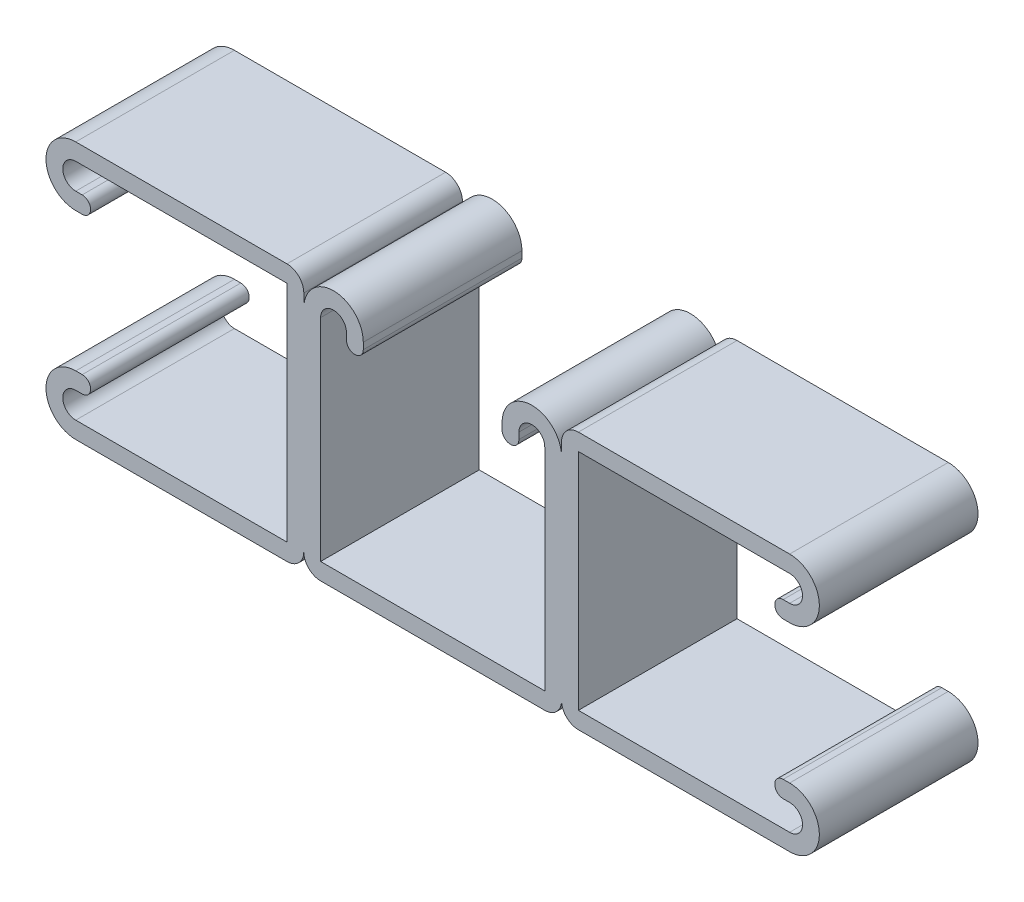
ISO-10303-21;
HEADER;
FILE_DESCRIPTION(('STEP AP214'),'2;1');
FILE_NAME('part.step','',(''),(''),'','','');
FILE_SCHEMA(('AUTOMOTIVE_DESIGN { 1 0 10303 214 1 1 1 1 }'));
ENDSEC;
DATA;
#1=APPLICATION_CONTEXT('core data for automotive mechanical design processes');
#2=APPLICATION_PROTOCOL_DEFINITION('international standard','automotive_design',2000,#1);
#3=PRODUCT_CONTEXT('',#1,'mechanical');
#4=PRODUCT('Part','Part','',(#3));
#5=PRODUCT_RELATED_PRODUCT_CATEGORY('part','',(#4));
#6=PRODUCT_DEFINITION_FORMATION('','',#4);
#7=PRODUCT_DEFINITION_CONTEXT('part definition',#1,'design');
#8=PRODUCT_DEFINITION('design','',#6,#7);
#9=PRODUCT_DEFINITION_SHAPE('','',#8);
#10=(LENGTH_UNIT() NAMED_UNIT(*) SI_UNIT(.MILLI.,.METRE.));
#11=(NAMED_UNIT(*) PLANE_ANGLE_UNIT() SI_UNIT($,.RADIAN.));
#12=(NAMED_UNIT(*) SI_UNIT($,.STERADIAN.) SOLID_ANGLE_UNIT());
#13=UNCERTAINTY_MEASURE_WITH_UNIT(LENGTH_MEASURE(1.E-05),#10,'distance_accuracy_value','');
#14=(GEOMETRIC_REPRESENTATION_CONTEXT(3) GLOBAL_UNCERTAINTY_ASSIGNED_CONTEXT((#13)) GLOBAL_UNIT_ASSIGNED_CONTEXT((#10,
#11,#12)) REPRESENTATION_CONTEXT('',''));
#15=CARTESIAN_POINT('',(0.,0.,0.));
#16=DIRECTION('',(0.,0.,1.));
#17=DIRECTION('',(1.,0.,0.));
#18=AXIS2_PLACEMENT_3D('',#15,#16,#17);
#19=CARTESIAN_POINT('',(4.7625,36.5125,12.7));
#20=DIRECTION('',(0.,0.,-1.));
#21=DIRECTION('',(-1.,0.,0.));
#22=AXIS2_PLACEMENT_3D('',#19,#20,#21);
#23=CYLINDRICAL_SURFACE('',#22,4.7625);
#24=CARTESIAN_POINT('',(4.7625,36.5125,-12.7));
#25=DIRECTION('',(0.,0.,1.));
#26=DIRECTION('',(-1.,0.,0.));
#27=AXIS2_PLACEMENT_3D('',#24,#25,#26);
#28=CIRCLE('',#27,4.7625);
#29=CARTESIAN_POINT('',(9.525,36.5125,-12.7));
#30=VERTEX_POINT('',#29);
#31=CARTESIAN_POINT('',(0.,36.5125,-12.7));
#32=VERTEX_POINT('',#31);
#33=EDGE_CURVE('E187',#30,#32,#28,.T.);
#34=ORIENTED_EDGE('',*,*,#33,.T.);
#35=DIRECTION('',(0.,0.,-1.));
#36=VECTOR('',#35,1.);
#37=CARTESIAN_POINT('',(0.,36.5125,12.7));
#38=LINE('',#37,#36);
#39=CARTESIAN_POINT('',(0.,36.5125,12.7));
#40=VERTEX_POINT('',#39);
#41=EDGE_CURVE('E11',#40,#32,#38,.T.);
#42=ORIENTED_EDGE('',*,*,#41,.F.);
#43=CARTESIAN_POINT('',(4.7625,36.5125,12.7));
#44=DIRECTION('',(0.,0.,1.));
#45=DIRECTION('',(-1.,0.,0.));
#46=AXIS2_PLACEMENT_3D('',#43,#44,#45);
#47=CIRCLE('',#46,4.7625);
#48=CARTESIAN_POINT('',(9.525,36.5125,12.7));
#49=VERTEX_POINT('',#48);
#50=EDGE_CURVE('E115',#49,#40,#47,.T.);
#51=ORIENTED_EDGE('',*,*,#50,.F.);
#52=DIRECTION('',(0.,0.,-1.));
#53=VECTOR('',#52,1.);
#54=CARTESIAN_POINT('',(9.525,36.5125,12.7));
#55=LINE('',#54,#53);
#56=EDGE_CURVE('E183',#49,#30,#55,.T.);
#57=ORIENTED_EDGE('',*,*,#56,.T.);
#58=EDGE_LOOP('',(#34,#42,#51,#57));
#59=FACE_BOUND('',#58,.T.);
#60=ADVANCED_FACE('F33',(#59),#23,.T.);
#61=CARTESIAN_POINT('',(2.6924,2.6924,12.7));
#62=DIRECTION('',(0.,0.,-1.));
#63=DIRECTION('',(-1.,0.,0.));
#64=AXIS2_PLACEMENT_3D('',#61,#62,#63);
#65=CYLINDRICAL_SURFACE('',#64,2.6924);
#66=CARTESIAN_POINT('',(2.6924,2.6924,-12.7));
#67=DIRECTION('',(0.,0.,1.));
#68=DIRECTION('',(-1.,0.,0.));
#69=AXIS2_PLACEMENT_3D('',#66,#67,#68);
#70=CIRCLE('',#69,2.6924);
#71=CARTESIAN_POINT('',(0.,2.6924,-12.7));
#72=VERTEX_POINT('',#71);
#73=CARTESIAN_POINT('',(2.6924,0.,-12.7));
#74=VERTEX_POINT('',#73);
#75=EDGE_CURVE('E189',#72,#74,#70,.T.);
#76=ORIENTED_EDGE('',*,*,#75,.T.);
#77=DIRECTION('',(0.,0.,-1.));
#78=VECTOR('',#77,1.);
#79=CARTESIAN_POINT('',(2.6924,0.,12.7));
#80=LINE('',#79,#78);
#81=CARTESIAN_POINT('',(2.6924,0.,12.7));
#82=VERTEX_POINT('',#81);
#83=EDGE_CURVE('E253',#82,#74,#80,.T.);
#84=ORIENTED_EDGE('',*,*,#83,.F.);
#85=CARTESIAN_POINT('',(2.6924,2.6924,12.7));
#86=DIRECTION('',(0.,0.,1.));
#87=DIRECTION('',(-1.,0.,0.));
#88=AXIS2_PLACEMENT_3D('',#85,#86,#87);
#89=CIRCLE('',#88,2.6924);
#90=CARTESIAN_POINT('',(0.,2.6924,12.7));
#91=VERTEX_POINT('',#90);
#92=EDGE_CURVE('E263',#91,#82,#89,.T.);
#93=ORIENTED_EDGE('',*,*,#92,.F.);
#94=DIRECTION('',(0.,0.,-1.));
#95=VECTOR('',#94,1.);
#96=CARTESIAN_POINT('',(0.,2.6924,12.7));
#97=LINE('',#96,#95);
#98=EDGE_CURVE('E41',#91,#72,#97,.T.);
#99=ORIENTED_EDGE('',*,*,#98,.T.);
#100=EDGE_LOOP('',(#76,#84,#93,#99));
#101=FACE_BOUND('',#100,.T.);
#102=ADVANCED_FACE('F260',(#101),#65,.T.);
#103=CARTESIAN_POINT('',(2.6924,0.,12.7));
#104=DIRECTION('',(0.,1.,0.));
#105=DIRECTION('',(0.,0.,1.));
#106=AXIS2_PLACEMENT_3D('',#103,#104,#105);
#107=PLANE('',#106);
#108=DIRECTION('',(1.,0.,0.));
#109=VECTOR('',#108,1.);
#110=CARTESIAN_POINT('',(2.6924,0.,-12.7));
#111=LINE('',#110,#109);
#112=CARTESIAN_POINT('',(38.5826,0.,-12.7));
#113=VERTEX_POINT('',#112);
#114=EDGE_CURVE('E192',#74,#113,#111,.T.);
#115=ORIENTED_EDGE('',*,*,#114,.T.);
#116=DIRECTION('',(0.,0.,-1.));
#117=VECTOR('',#116,1.);
#118=CARTESIAN_POINT('',(38.5826,0.,12.7));
#119=LINE('',#118,#117);
#120=CARTESIAN_POINT('',(38.5826,0.,12.7));
#121=VERTEX_POINT('',#120);
#122=EDGE_CURVE('E250',#121,#113,#119,.T.);
#123=ORIENTED_EDGE('',*,*,#122,.F.);
#124=DIRECTION('',(1.,0.,0.));
#125=VECTOR('',#124,1.);
#126=CARTESIAN_POINT('',(2.6924,0.,12.7));
#127=LINE('',#126,#125);
#128=EDGE_CURVE('E382',#82,#121,#127,.T.);
#129=ORIENTED_EDGE('',*,*,#128,.F.);
#130=ORIENTED_EDGE('',*,*,#83,.T.);
#131=EDGE_LOOP('',(#115,#123,#129,#130));
#132=FACE_BOUND('',#131,.T.);
#133=ADVANCED_FACE('F583',(#132),#107,.F.);
#134=CARTESIAN_POINT('',(38.5826,2.6924,12.7));
#135=DIRECTION('',(0.,0.,-1.));
#136=DIRECTION('',(-1.,0.,0.));
#137=AXIS2_PLACEMENT_3D('',#134,#135,#136);
#138=CYLINDRICAL_SURFACE('',#137,2.6924);
#139=CARTESIAN_POINT('',(38.5826,2.6924,-12.7));
#140=DIRECTION('',(0.,0.,1.));
#141=DIRECTION('',(1.,0.,0.));
#142=AXIS2_PLACEMENT_3D('',#139,#140,#141);
#143=CIRCLE('',#142,2.6924);
#144=CARTESIAN_POINT('',(41.275,2.6924,-12.7));
#145=VERTEX_POINT('',#144);
#146=EDGE_CURVE('E194',#113,#145,#143,.T.);
#147=ORIENTED_EDGE('',*,*,#146,.T.);
#148=DIRECTION('',(0.,0.,-1.));
#149=VECTOR('',#148,1.);
#150=CARTESIAN_POINT('',(41.275,2.6924,12.7));
#151=LINE('',#150,#149);
#152=CARTESIAN_POINT('',(41.275,2.6924,12.7));
#153=VERTEX_POINT('',#152);
#154=EDGE_CURVE('E247',#153,#145,#151,.T.);
#155=ORIENTED_EDGE('',*,*,#154,.F.);
#156=CARTESIAN_POINT('',(38.5826,2.6924,12.7));
#157=DIRECTION('',(0.,0.,1.));
#158=DIRECTION('',(1.,0.,0.));
#159=AXIS2_PLACEMENT_3D('',#156,#157,#158);
#160=CIRCLE('',#159,2.6924);
#161=EDGE_CURVE('E384',#121,#153,#160,.T.);
#162=ORIENTED_EDGE('',*,*,#161,.F.);
#163=ORIENTED_EDGE('',*,*,#122,.T.);
#164=EDGE_LOOP('',(#147,#155,#162,#163));
#165=FACE_BOUND('',#164,.T.);
#166=ADVANCED_FACE('F587',(#165),#138,.T.);
#167=CARTESIAN_POINT('',(36.5125,36.5125,12.7));
#168=DIRECTION('',(0.,0.,-1.));
#169=DIRECTION('',(-1.,0.,0.));
#170=AXIS2_PLACEMENT_3D('',#167,#168,#169);
#171=CYLINDRICAL_SURFACE('',#170,4.7625);
#172=CARTESIAN_POINT('',(36.5125,36.5125,-12.7));
#173=DIRECTION('',(0.,0.,1.));
#174=DIRECTION('',(1.,0.,0.));
#175=AXIS2_PLACEMENT_3D('',#172,#173,#174);
#176=CIRCLE('',#175,4.7625);
#177=CARTESIAN_POINT('',(41.2750000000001,36.5125,-12.7));
#178=VERTEX_POINT('',#177);
#179=CARTESIAN_POINT('',(31.75,36.5125,-12.7));
#180=VERTEX_POINT('',#179);
#181=EDGE_CURVE('E196',#178,#180,#176,.T.);
#182=ORIENTED_EDGE('',*,*,#181,.T.);
#183=DIRECTION('',(0.,0.,-1.));
#184=VECTOR('',#183,1.);
#185=CARTESIAN_POINT('',(31.75,36.5125,12.7));
#186=LINE('',#185,#184);
#187=CARTESIAN_POINT('',(31.75,36.5125,12.7));
#188=VERTEX_POINT('',#187);
#189=EDGE_CURVE('E241',#188,#180,#186,.T.);
#190=ORIENTED_EDGE('',*,*,#189,.F.);
#191=CARTESIAN_POINT('',(36.5125,36.5125,12.7));
#192=DIRECTION('',(0.,0.,1.));
#193=DIRECTION('',(1.,0.,0.));
#194=AXIS2_PLACEMENT_3D('',#191,#192,#193);
#195=CIRCLE('',#194,4.7625);
#196=CARTESIAN_POINT('',(41.275,36.5125,12.7));
#197=VERTEX_POINT('',#196);
#198=EDGE_CURVE('E386',#197,#188,#195,.T.);
#199=ORIENTED_EDGE('',*,*,#198,.F.);
#200=DIRECTION('',(0.,0.,-1.));
#201=VECTOR('',#200,1.);
#202=CARTESIAN_POINT('',(41.275,36.5125,12.7));
#203=LINE('',#202,#201);
#204=EDGE_CURVE('E244',#197,#178,#203,.T.);
#205=ORIENTED_EDGE('',*,*,#204,.T.);
#206=EDGE_LOOP('',(#182,#190,#199,#205));
#207=FACE_BOUND('',#206,.T.);
#208=ADVANCED_FACE('F593',(#207),#171,.T.);
#209=CARTESIAN_POINT('',(31.75,36.5125,12.7));
#210=DIRECTION('',(1.,0.,0.));
#211=DIRECTION('',(0.,0.,-1.));
#212=AXIS2_PLACEMENT_3D('',#209,#210,#211);
#213=PLANE('',#212);
#214=DIRECTION('',(0.,-1.,0.));
#215=VECTOR('',#214,1.);
#216=CARTESIAN_POINT('',(31.75,36.5125,-12.7));
#217=LINE('',#216,#215);
#218=CARTESIAN_POINT('',(31.75,35.47745,-12.7));
#219=VERTEX_POINT('',#218);
#220=EDGE_CURVE('E198',#180,#219,#217,.T.);
#221=ORIENTED_EDGE('',*,*,#220,.T.);
#222=DIRECTION('',(0.,0.,-1.));
#223=VECTOR('',#222,1.);
#224=CARTESIAN_POINT('',(31.75,35.47745,12.7));
#225=LINE('',#224,#223);
#226=CARTESIAN_POINT('',(31.75,35.47745,12.7));
#227=VERTEX_POINT('',#226);
#228=EDGE_CURVE('E238',#227,#219,#225,.T.);
#229=ORIENTED_EDGE('',*,*,#228,.F.);
#230=DIRECTION('',(0.,-1.,0.));
#231=VECTOR('',#230,1.);
#232=CARTESIAN_POINT('',(31.75,36.5125,12.7));
#233=LINE('',#232,#231);
#234=EDGE_CURVE('E388',#188,#227,#233,.T.);
#235=ORIENTED_EDGE('',*,*,#234,.F.);
#236=ORIENTED_EDGE('',*,*,#189,.T.);
#237=EDGE_LOOP('',(#221,#229,#235,#236));
#238=FACE_BOUND('',#237,.T.);
#239=ADVANCED_FACE('F597',(#238),#213,.F.);
#240=CARTESIAN_POINT('',(33.0962,35.47745,12.7));
#241=DIRECTION('',(0.,0.,-1.));
#242=DIRECTION('',(-1.,0.,0.));
#243=AXIS2_PLACEMENT_3D('',#240,#241,#242);
#244=CYLINDRICAL_SURFACE('',#243,1.3462);
#245=CARTESIAN_POINT('',(33.0962,35.47745,-12.7));
#246=DIRECTION('',(0.,0.,1.));
#247=DIRECTION('',(1.,0.,0.));
#248=AXIS2_PLACEMENT_3D('',#245,#246,#247);
#249=CIRCLE('',#248,1.3462);
#250=CARTESIAN_POINT('',(34.4424,35.47745,-12.7));
#251=VERTEX_POINT('',#250);
#252=EDGE_CURVE('E200',#219,#251,#249,.T.);
#253=ORIENTED_EDGE('',*,*,#252,.T.);
#254=DIRECTION('',(0.,0.,-1.));
#255=VECTOR('',#254,1.);
#256=CARTESIAN_POINT('',(34.4424,35.47745,12.7));
#257=LINE('',#256,#255);
#258=CARTESIAN_POINT('',(34.4424,35.47745,12.7));
#259=VERTEX_POINT('',#258);
#260=EDGE_CURVE('E235',#259,#251,#257,.T.);
#261=ORIENTED_EDGE('',*,*,#260,.F.);
#262=CARTESIAN_POINT('',(33.0962,35.47745,12.7));
#263=DIRECTION('',(0.,0.,1.));
#264=DIRECTION('',(1.,0.,0.));
#265=AXIS2_PLACEMENT_3D('',#262,#263,#264);
#266=CIRCLE('',#265,1.3462);
#267=EDGE_CURVE('E390',#227,#259,#266,.T.);
#268=ORIENTED_EDGE('',*,*,#267,.F.);
#269=ORIENTED_EDGE('',*,*,#228,.T.);
#270=EDGE_LOOP('',(#253,#261,#268,#269));
#271=FACE_BOUND('',#270,.T.);
#272=ADVANCED_FACE('F601',(#271),#244,.T.);
#273=CARTESIAN_POINT('',(34.4424,36.5125,12.7));
#274=DIRECTION('',(-1.,0.,0.));
#275=DIRECTION('',(0.,0.,1.));
#276=AXIS2_PLACEMENT_3D('',#273,#274,#275);
#277=PLANE('',#276);
#278=DIRECTION('',(0.,1.,0.));
#279=VECTOR('',#278,1.);
#280=CARTESIAN_POINT('',(34.4424,36.5125,-12.7));
#281=LINE('',#280,#279);
#282=CARTESIAN_POINT('',(34.4424,36.5125,-12.7));
#283=VERTEX_POINT('',#282);
#284=EDGE_CURVE('E202',#251,#283,#281,.T.);
#285=ORIENTED_EDGE('',*,*,#284,.T.);
#286=DIRECTION('',(0.,0.,-1.));
#287=VECTOR('',#286,1.);
#288=CARTESIAN_POINT('',(34.4424,36.5125,12.7));
#289=LINE('',#288,#287);
#290=CARTESIAN_POINT('',(34.4424,36.5125,12.7));
#291=VERTEX_POINT('',#290);
#292=EDGE_CURVE('E232',#291,#283,#289,.T.);
#293=ORIENTED_EDGE('',*,*,#292,.F.);
#294=DIRECTION('',(0.,1.,0.));
#295=VECTOR('',#294,1.);
#296=CARTESIAN_POINT('',(34.4424,36.5125,12.7));
#297=LINE('',#296,#295);
#298=EDGE_CURVE('E392',#259,#291,#297,.T.);
#299=ORIENTED_EDGE('',*,*,#298,.F.);
#300=ORIENTED_EDGE('',*,*,#260,.T.);
#301=EDGE_LOOP('',(#285,#293,#299,#300));
#302=FACE_BOUND('',#301,.T.);
#303=ADVANCED_FACE('F605',(#302),#277,.F.);
#304=CARTESIAN_POINT('',(36.5125,36.5125,12.7));
#305=DIRECTION('',(0.,0.,-1.));
#306=DIRECTION('',(-1.,0.,0.));
#307=AXIS2_PLACEMENT_3D('',#304,#305,#306);
#308=CYLINDRICAL_SURFACE('',#307,2.0701);
#309=CARTESIAN_POINT('',(36.5125,36.5125,-12.7));
#310=DIRECTION('',(0.,0.,-1.));
#311=DIRECTION('',(1.,0.,0.));
#312=AXIS2_PLACEMENT_3D('',#309,#310,#311);
#313=CIRCLE('',#312,2.0701);
#314=CARTESIAN_POINT('',(38.5826,36.5125,-12.7));
#315=VERTEX_POINT('',#314);
#316=EDGE_CURVE('E204',#283,#315,#313,.T.);
#317=ORIENTED_EDGE('',*,*,#316,.T.);
#318=DIRECTION('',(0.,0.,-1.));
#319=VECTOR('',#318,1.);
#320=CARTESIAN_POINT('',(38.5826,36.5125,12.7));
#321=LINE('',#320,#319);
#322=CARTESIAN_POINT('',(38.5826,36.5125,12.7));
#323=VERTEX_POINT('',#322);
#324=EDGE_CURVE('E229',#323,#315,#321,.T.);
#325=ORIENTED_EDGE('',*,*,#324,.F.);
#326=CARTESIAN_POINT('',(36.5125,36.5125,12.7));
#327=DIRECTION('',(0.,0.,-1.));
#328=DIRECTION('',(1.,0.,0.));
#329=AXIS2_PLACEMENT_3D('',#326,#327,#328);
#330=CIRCLE('',#329,2.0701);
#331=EDGE_CURVE('E394',#291,#323,#330,.T.);
#332=ORIENTED_EDGE('',*,*,#331,.F.);
#333=ORIENTED_EDGE('',*,*,#292,.T.);
#334=EDGE_LOOP('',(#317,#325,#332,#333));
#335=FACE_BOUND('',#334,.T.);
#336=ADVANCED_FACE('F609',(#335),#308,.F.);
#337=CARTESIAN_POINT('',(38.5826,2.6924,12.7));
#338=DIRECTION('',(1.,0.,0.));
#339=DIRECTION('',(0.,1.,0.));
#340=AXIS2_PLACEMENT_3D('',#337,#338,#339);
#341=PLANE('',#340);
#342=DIRECTION('',(0.,-1.,0.));
#343=VECTOR('',#342,1.);
#344=CARTESIAN_POINT('',(38.5826,2.6924,-12.7));
#345=LINE('',#344,#343);
#346=CARTESIAN_POINT('',(38.5826,2.6924,-12.7));
#347=VERTEX_POINT('',#346);
#348=EDGE_CURVE('E206',#315,#347,#345,.T.);
#349=ORIENTED_EDGE('',*,*,#348,.T.);
#350=DIRECTION('',(0.,0.,-1.));
#351=VECTOR('',#350,1.);
#352=CARTESIAN_POINT('',(38.5826,2.6924,12.7));
#353=LINE('',#352,#351);
#354=CARTESIAN_POINT('',(38.5826,2.6924,12.7));
#355=VERTEX_POINT('',#354);
#356=EDGE_CURVE('E226',#355,#347,#353,.T.);
#357=ORIENTED_EDGE('',*,*,#356,.F.);
#358=DIRECTION('',(0.,-1.,0.));
#359=VECTOR('',#358,1.);
#360=CARTESIAN_POINT('',(38.5826,2.6924,12.7));
#361=LINE('',#360,#359);
#362=EDGE_CURVE('E396',#323,#355,#361,.T.);
#363=ORIENTED_EDGE('',*,*,#362,.F.);
#364=ORIENTED_EDGE('',*,*,#324,.T.);
#365=EDGE_LOOP('',(#349,#357,#363,#364));
#366=FACE_BOUND('',#365,.T.);
#367=ADVANCED_FACE('F613',(#366),#341,.F.);
#368=CARTESIAN_POINT('',(2.6924,2.6924,12.7));
#369=DIRECTION('',(0.,-1.,0.));
#370=DIRECTION('',(1.,0.,0.));
#371=AXIS2_PLACEMENT_3D('',#368,#369,#370);
#372=PLANE('',#371);
#373=DIRECTION('',(-1.,0.,0.));
#374=VECTOR('',#373,1.);
#375=CARTESIAN_POINT('',(2.6924,2.6924,-12.7));
#376=LINE('',#375,#374);
#377=CARTESIAN_POINT('',(2.6924,2.6924,-12.7));
#378=VERTEX_POINT('',#377);
#379=EDGE_CURVE('E208',#347,#378,#376,.T.);
#380=ORIENTED_EDGE('',*,*,#379,.T.);
#381=DIRECTION('',(0.,0.,-1.));
#382=VECTOR('',#381,1.);
#383=CARTESIAN_POINT('',(2.6924,2.6924,12.7));
#384=LINE('',#383,#382);
#385=CARTESIAN_POINT('',(2.6924,2.6924,12.7));
#386=VERTEX_POINT('',#385);
#387=EDGE_CURVE('E223',#386,#378,#384,.T.);
#388=ORIENTED_EDGE('',*,*,#387,.F.);
#389=DIRECTION('',(-1.,0.,0.));
#390=VECTOR('',#389,1.);
#391=CARTESIAN_POINT('',(2.6924,2.6924,12.7));
#392=LINE('',#391,#390);
#393=EDGE_CURVE('E398',#355,#386,#392,.T.);
#394=ORIENTED_EDGE('',*,*,#393,.F.);
#395=ORIENTED_EDGE('',*,*,#356,.T.);
#396=EDGE_LOOP('',(#380,#388,#394,#395));
#397=FACE_BOUND('',#396,.T.);
#398=ADVANCED_FACE('F617',(#397),#372,.F.);
#399=CARTESIAN_POINT('',(2.6924,36.5125,12.7));
#400=DIRECTION('',(-1.,0.,0.));
#401=DIRECTION('',(0.,-1.,0.));
#402=AXIS2_PLACEMENT_3D('',#399,#400,#401);
#403=PLANE('',#402);
#404=DIRECTION('',(0.,1.,0.));
#405=VECTOR('',#404,1.);
#406=CARTESIAN_POINT('',(2.6924,36.5125,-12.7));
#407=LINE('',#406,#405);
#408=CARTESIAN_POINT('',(2.6924,36.5125,-12.7));
#409=VERTEX_POINT('',#408);
#410=EDGE_CURVE('E210',#378,#409,#407,.T.);
#411=ORIENTED_EDGE('',*,*,#410,.T.);
#412=DIRECTION('',(0.,0.,-1.));
#413=VECTOR('',#412,1.);
#414=CARTESIAN_POINT('',(2.6924,36.5125,12.7));
#415=LINE('',#414,#413);
#416=CARTESIAN_POINT('',(2.6924,36.5125,12.7));
#417=VERTEX_POINT('',#416);
#418=EDGE_CURVE('E220',#417,#409,#415,.T.);
#419=ORIENTED_EDGE('',*,*,#418,.F.);
#420=DIRECTION('',(0.,1.,0.));
#421=VECTOR('',#420,1.);
#422=CARTESIAN_POINT('',(2.6924,36.5125,12.7));
#423=LINE('',#422,#421);
#424=EDGE_CURVE('E400',#386,#417,#423,.T.);
#425=ORIENTED_EDGE('',*,*,#424,.F.);
#426=ORIENTED_EDGE('',*,*,#387,.T.);
#427=EDGE_LOOP('',(#411,#419,#425,#426));
#428=FACE_BOUND('',#427,.T.);
#429=ADVANCED_FACE('F406',(#428),#403,.F.);
#430=CARTESIAN_POINT('',(4.7625,36.5125,12.7));
#431=DIRECTION('',(0.,0.,-1.));
#432=DIRECTION('',(-1.,0.,0.));
#433=AXIS2_PLACEMENT_3D('',#430,#431,#432);
#434=CYLINDRICAL_SURFACE('',#433,2.0701);
#435=CARTESIAN_POINT('',(4.7625,36.5125,-12.7));
#436=DIRECTION('',(0.,0.,-1.));
#437=DIRECTION('',(-1.,0.,0.));
#438=AXIS2_PLACEMENT_3D('',#435,#436,#437);
#439=CIRCLE('',#438,2.0701);
#440=CARTESIAN_POINT('',(6.8326,36.5125,-12.7));
#441=VERTEX_POINT('',#440);
#442=EDGE_CURVE('E212',#409,#441,#439,.T.);
#443=ORIENTED_EDGE('',*,*,#442,.T.);
#444=DIRECTION('',(0.,0.,-1.));
#445=VECTOR('',#444,1.);
#446=CARTESIAN_POINT('',(6.8326,36.5125,12.7));
#447=LINE('',#446,#445);
#448=CARTESIAN_POINT('',(6.8326,36.5125,12.7));
#449=VERTEX_POINT('',#448);
#450=EDGE_CURVE('E178',#449,#441,#447,.T.);
#451=ORIENTED_EDGE('',*,*,#450,.F.);
#452=CARTESIAN_POINT('',(4.7625,36.5125,12.7));
#453=DIRECTION('',(0.,0.,-1.));
#454=DIRECTION('',(-1.,0.,0.));
#455=AXIS2_PLACEMENT_3D('',#452,#453,#454);
#456=CIRCLE('',#455,2.0701);
#457=EDGE_CURVE('E169',#417,#449,#456,.T.);
#458=ORIENTED_EDGE('',*,*,#457,.F.);
#459=ORIENTED_EDGE('',*,*,#418,.T.);
#460=EDGE_LOOP('',(#443,#451,#458,#459));
#461=FACE_BOUND('',#460,.T.);
#462=ADVANCED_FACE('F410',(#461),#434,.F.);
#463=CARTESIAN_POINT('',(6.8326,36.5125,12.7));
#464=DIRECTION('',(1.,0.,0.));
#465=DIRECTION('',(0.,0.,-1.));
#466=AXIS2_PLACEMENT_3D('',#463,#464,#465);
#467=PLANE('',#466);
#468=DIRECTION('',(0.,-1.,0.));
#469=VECTOR('',#468,1.);
#470=CARTESIAN_POINT('',(6.8326,36.5125,-12.7));
#471=LINE('',#470,#469);
#472=CARTESIAN_POINT('',(6.8326,35.47745,-12.7));
#473=VERTEX_POINT('',#472);
#474=EDGE_CURVE('E177',#441,#473,#471,.T.);
#475=ORIENTED_EDGE('',*,*,#474,.T.);
#476=DIRECTION('',(0.,0.,-1.));
#477=VECTOR('',#476,1.);
#478=CARTESIAN_POINT('',(6.8326,35.47745,12.7));
#479=LINE('',#478,#477);
#480=CARTESIAN_POINT('',(6.8326,35.47745,12.7));
#481=VERTEX_POINT('',#480);
#482=EDGE_CURVE('E174',#481,#473,#479,.T.);
#483=ORIENTED_EDGE('',*,*,#482,.F.);
#484=DIRECTION('',(0.,-1.,0.));
#485=VECTOR('',#484,1.);
#486=CARTESIAN_POINT('',(6.8326,36.5125,12.7));
#487=LINE('',#486,#485);
#488=EDGE_CURVE('E163',#449,#481,#487,.T.);
#489=ORIENTED_EDGE('',*,*,#488,.F.);
#490=ORIENTED_EDGE('',*,*,#450,.T.);
#491=EDGE_LOOP('',(#475,#483,#489,#490));
#492=FACE_BOUND('',#491,.T.);
#493=ADVANCED_FACE('F175',(#492),#467,.F.);
#494=CARTESIAN_POINT('',(8.1788,35.47745,12.7));
#495=DIRECTION('',(0.,0.,-1.));
#496=DIRECTION('',(-1.,0.,0.));
#497=AXIS2_PLACEMENT_3D('',#494,#495,#496);
#498=CYLINDRICAL_SURFACE('',#497,1.3462);
#499=CARTESIAN_POINT('',(8.1788,35.47745,-12.7));
#500=DIRECTION('',(0.,0.,1.));
#501=DIRECTION('',(-1.,0.,0.));
#502=AXIS2_PLACEMENT_3D('',#499,#500,#501);
#503=CIRCLE('',#502,1.3462);
#504=CARTESIAN_POINT('',(9.525,35.47745,-12.7));
#505=VERTEX_POINT('',#504);
#506=EDGE_CURVE('E103',#473,#505,#503,.T.);
#507=ORIENTED_EDGE('',*,*,#506,.T.);
#508=DIRECTION('',(0.,0.,-1.));
#509=VECTOR('',#508,1.);
#510=CARTESIAN_POINT('',(9.525,35.47745,12.7));
#511=LINE('',#510,#509);
#512=CARTESIAN_POINT('',(9.525,35.47745,12.7));
#513=VERTEX_POINT('',#512);
#514=EDGE_CURVE('E179',#513,#505,#511,.T.);
#515=ORIENTED_EDGE('',*,*,#514,.F.);
#516=CARTESIAN_POINT('',(8.1788,35.47745,12.7));
#517=DIRECTION('',(0.,0.,1.));
#518=DIRECTION('',(-1.,0.,0.));
#519=AXIS2_PLACEMENT_3D('',#516,#517,#518);
#520=CIRCLE('',#519,1.3462);
#521=EDGE_CURVE('E167',#481,#513,#520,.T.);
#522=ORIENTED_EDGE('',*,*,#521,.F.);
#523=ORIENTED_EDGE('',*,*,#482,.T.);
#524=EDGE_LOOP('',(#507,#515,#522,#523));
#525=FACE_BOUND('',#524,.T.);
#526=ADVANCED_FACE('F181',(#525),#498,.T.);
#527=CARTESIAN_POINT('',(9.525,36.5125,12.7));
#528=DIRECTION('',(-1.,0.,0.));
#529=DIRECTION('',(0.,-1.,0.));
#530=AXIS2_PLACEMENT_3D('',#527,#528,#529);
#531=PLANE('',#530);
#532=DIRECTION('',(0.,1.,0.));
#533=VECTOR('',#532,1.);
#534=CARTESIAN_POINT('',(9.525,36.5125,-12.7));
#535=LINE('',#534,#533);
#536=EDGE_CURVE('E109',#505,#30,#535,.T.);
#537=ORIENTED_EDGE('',*,*,#536,.T.);
#538=ORIENTED_EDGE('',*,*,#56,.F.);
#539=DIRECTION('',(0.,1.,0.));
#540=VECTOR('',#539,1.);
#541=CARTESIAN_POINT('',(9.525,36.5125,12.7));
#542=LINE('',#541,#540);
#543=EDGE_CURVE('E49',#513,#49,#542,.T.);
#544=ORIENTED_EDGE('',*,*,#543,.F.);
#545=ORIENTED_EDGE('',*,*,#514,.T.);
#546=EDGE_LOOP('',(#537,#538,#544,#545));
#547=FACE_BOUND('',#546,.T.);
#548=ADVANCED_FACE('F630',(#547),#531,.F.);
#549=CARTESIAN_POINT('',(4.7625,36.5125,12.7));
#550=DIRECTION('',(0.,0.,-1.));
#551=DIRECTION('',(-1.,0.,0.));
#552=AXIS2_PLACEMENT_3D('',#549,#550,#551);
#553=PLANE('',#552);
#554=ORIENTED_EDGE('',*,*,#50,.T.);
#555=DIRECTION('',(0.,1.,0.));
#556=VECTOR('',#555,1.);
#557=CARTESIAN_POINT('',(0.,2.6924,12.7));
#558=LINE('',#557,#556);
#559=CARTESIAN_POINT('',(-1.34710505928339E-13,38.5826,12.7));
#560=VERTEX_POINT('',#559);
#561=EDGE_CURVE('E420',#40,#560,#558,.T.);
#562=ORIENTED_EDGE('',*,*,#561,.T.);
#563=CARTESIAN_POINT('',(-2.69240000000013,38.5826,12.7));
#564=DIRECTION('',(0.,0.,1.));
#565=DIRECTION('',(0.,1.,0.));
#566=AXIS2_PLACEMENT_3D('',#563,#564,#565);
#567=CIRCLE('',#566,2.6924);
#568=CARTESIAN_POINT('',(-2.69240000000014,41.275,12.7));
#569=VERTEX_POINT('',#568);
#570=EDGE_CURVE('E424',#560,#569,#567,.T.);
#571=ORIENTED_EDGE('',*,*,#570,.T.);
#572=DIRECTION('',(-1.,0.,0.));
#573=VECTOR('',#572,1.);
#574=CARTESIAN_POINT('',(-2.69240000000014,41.275,12.7));
#575=LINE('',#574,#573);
#576=CARTESIAN_POINT('',(-36.5125000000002,41.2749999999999,12.7));
#577=VERTEX_POINT('',#576);
#578=EDGE_CURVE('E427',#569,#577,#575,.T.);
#579=ORIENTED_EDGE('',*,*,#578,.T.);
#580=CARTESIAN_POINT('',(-36.5125000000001,36.5124999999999,12.7));
#581=DIRECTION('',(0.,0.,1.));
#582=DIRECTION('',(0.,1.,0.));
#583=AXIS2_PLACEMENT_3D('',#580,#581,#582);
#584=CIRCLE('',#583,4.7625);
#585=CARTESIAN_POINT('',(-36.5125000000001,31.7499999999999,12.7));
#586=VERTEX_POINT('',#585);
#587=EDGE_CURVE('E435',#577,#586,#584,.T.);
#588=ORIENTED_EDGE('',*,*,#587,.T.);
#589=DIRECTION('',(1.,0.,0.));
#590=VECTOR('',#589,1.);
#591=CARTESIAN_POINT('',(-36.5125000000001,31.7499999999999,12.7));
#592=LINE('',#591,#590);
#593=CARTESIAN_POINT('',(-35.4774500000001,31.7499999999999,12.7));
#594=VERTEX_POINT('',#593);
#595=EDGE_CURVE('E438',#586,#594,#592,.T.);
#596=ORIENTED_EDGE('',*,*,#595,.T.);
#597=CARTESIAN_POINT('',(-35.4774500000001,33.0961999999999,12.7));
#598=DIRECTION('',(0.,0.,1.));
#599=DIRECTION('',(0.,1.,0.));
#600=AXIS2_PLACEMENT_3D('',#597,#598,#599);
#601=CIRCLE('',#600,1.3462);
#602=CARTESIAN_POINT('',(-35.4774500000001,34.4423999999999,12.7));
#603=VERTEX_POINT('',#602);
#604=EDGE_CURVE('E441',#594,#603,#601,.T.);
#605=ORIENTED_EDGE('',*,*,#604,.T.);
#606=DIRECTION('',(-1.,0.,0.));
#607=VECTOR('',#606,1.);
#608=CARTESIAN_POINT('',(-36.5125000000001,34.4423999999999,12.7));
#609=LINE('',#608,#607);
#610=CARTESIAN_POINT('',(-36.5125000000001,34.4423999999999,12.7));
#611=VERTEX_POINT('',#610);
#612=EDGE_CURVE('E444',#603,#611,#609,.T.);
#613=ORIENTED_EDGE('',*,*,#612,.T.);
#614=CARTESIAN_POINT('',(-36.5125000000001,36.5124999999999,12.7));
#615=DIRECTION('',(0.,0.,-1.));
#616=DIRECTION('',(0.,1.,0.));
#617=AXIS2_PLACEMENT_3D('',#614,#615,#616);
#618=CIRCLE('',#617,2.0701);
#619=CARTESIAN_POINT('',(-36.5125000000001,38.5825999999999,12.7));
#620=VERTEX_POINT('',#619);
#621=EDGE_CURVE('E447',#611,#620,#618,.T.);
#622=ORIENTED_EDGE('',*,*,#621,.T.);
#623=DIRECTION('',(1.,0.,0.));
#624=VECTOR('',#623,1.);
#625=CARTESIAN_POINT('',(-2.69240000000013,38.5826,12.7));
#626=LINE('',#625,#624);
#627=CARTESIAN_POINT('',(-2.69240000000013,38.5826,12.7));
#628=VERTEX_POINT('',#627);
#629=EDGE_CURVE('E450',#620,#628,#626,.T.);
#630=ORIENTED_EDGE('',*,*,#629,.T.);
#631=DIRECTION('',(0.,-1.,0.));
#632=VECTOR('',#631,1.);
#633=CARTESIAN_POINT('',(-2.69240000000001,2.69239999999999,12.7));
#634=LINE('',#633,#632);
#635=CARTESIAN_POINT('',(-2.69240000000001,2.69239999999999,12.7));
#636=VERTEX_POINT('',#635);
#637=EDGE_CURVE('E453',#628,#636,#634,.T.);
#638=ORIENTED_EDGE('',*,*,#637,.T.);
#639=DIRECTION('',(-1.,0.,0.));
#640=VECTOR('',#639,1.);
#641=CARTESIAN_POINT('',(-36.5125,2.69239999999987,12.7));
#642=LINE('',#641,#640);
#643=CARTESIAN_POINT('',(-36.5125,2.69239999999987,12.7));
#644=VERTEX_POINT('',#643);
#645=EDGE_CURVE('E456',#636,#644,#642,.T.);
#646=ORIENTED_EDGE('',*,*,#645,.T.);
#647=CARTESIAN_POINT('',(-36.5125,4.76249999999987,12.7));
#648=DIRECTION('',(0.,0.,-1.));
#649=DIRECTION('',(0.,-1.,0.));
#650=AXIS2_PLACEMENT_3D('',#647,#648,#649);
#651=CIRCLE('',#650,2.0701);
#652=CARTESIAN_POINT('',(-36.5125,6.83259999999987,12.7));
#653=VERTEX_POINT('',#652);
#654=EDGE_CURVE('E459',#644,#653,#651,.T.);
#655=ORIENTED_EDGE('',*,*,#654,.T.);
#656=DIRECTION('',(1.,0.,0.));
#657=VECTOR('',#656,1.);
#658=CARTESIAN_POINT('',(-36.5125,6.83259999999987,12.7));
#659=LINE('',#658,#657);
#660=CARTESIAN_POINT('',(-35.47745,6.83259999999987,12.7));
#661=VERTEX_POINT('',#660);
#662=EDGE_CURVE('E462',#653,#661,#659,.T.);
#663=ORIENTED_EDGE('',*,*,#662,.T.);
#664=CARTESIAN_POINT('',(-35.47745,8.17879999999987,12.7));
#665=DIRECTION('',(0.,0.,1.));
#666=DIRECTION('',(0.,-1.,0.));
#667=AXIS2_PLACEMENT_3D('',#664,#665,#666);
#668=CIRCLE('',#667,1.3462);
#669=CARTESIAN_POINT('',(-35.47745,9.52499999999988,12.7));
#670=VERTEX_POINT('',#669);
#671=EDGE_CURVE('E465',#661,#670,#668,.T.);
#672=ORIENTED_EDGE('',*,*,#671,.T.);
#673=DIRECTION('',(-1.,0.,0.));
#674=VECTOR('',#673,1.);
#675=CARTESIAN_POINT('',(-36.5125,9.52499999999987,12.7));
#676=LINE('',#675,#674);
#677=CARTESIAN_POINT('',(-36.5125,9.52499999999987,12.7));
#678=VERTEX_POINT('',#677);
#679=EDGE_CURVE('E335',#670,#678,#676,.T.);
#680=ORIENTED_EDGE('',*,*,#679,.T.);
#681=CARTESIAN_POINT('',(-36.5125,4.76249999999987,12.7));
#682=DIRECTION('',(0.,0.,1.));
#683=DIRECTION('',(0.,-1.,0.));
#684=AXIS2_PLACEMENT_3D('',#681,#682,#683);
#685=CIRCLE('',#684,4.7625);
#686=CARTESIAN_POINT('',(-36.5125,-1.30084871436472E-13,12.7));
#687=VERTEX_POINT('',#686);
#688=EDGE_CURVE('E330',#678,#687,#685,.T.);
#689=ORIENTED_EDGE('',*,*,#688,.T.);
#690=DIRECTION('',(1.,0.,0.));
#691=VECTOR('',#690,1.);
#692=CARTESIAN_POINT('',(-36.5125,-1.30084871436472E-13,12.7));
#693=LINE('',#692,#691);
#694=CARTESIAN_POINT('',(-2.6924,0.,12.7));
#695=VERTEX_POINT('',#694);
#696=EDGE_CURVE('E429',#687,#695,#693,.T.);
#697=ORIENTED_EDGE('',*,*,#696,.T.);
#698=CARTESIAN_POINT('',(-2.69240000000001,2.69239999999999,12.7));
#699=DIRECTION('',(0.,0.,1.));
#700=DIRECTION('',(0.,-1.,0.));
#701=AXIS2_PLACEMENT_3D('',#698,#699,#700);
#702=CIRCLE('',#701,2.6924);
#703=EDGE_CURVE('E425',#695,#91,#702,.T.);
#704=ORIENTED_EDGE('',*,*,#703,.T.);
#705=ORIENTED_EDGE('',*,*,#92,.T.);
#706=ORIENTED_EDGE('',*,*,#128,.T.);
#707=ORIENTED_EDGE('',*,*,#161,.T.);
#708=CARTESIAN_POINT('',(43.9674,2.69239999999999,12.7));
#709=DIRECTION('',(0.,0.,1.));
#710=DIRECTION('',(0.,-1.,0.));
#711=AXIS2_PLACEMENT_3D('',#708,#709,#710);
#712=CIRCLE('',#711,2.6924);
#713=CARTESIAN_POINT('',(43.9674,0.,12.7));
#714=VERTEX_POINT('',#713);
#715=EDGE_CURVE('E1203',#153,#714,#712,.T.);
#716=ORIENTED_EDGE('',*,*,#715,.T.);
#717=DIRECTION('',(1.,0.,0.));
#718=VECTOR('',#717,1.);
#719=CARTESIAN_POINT('',(43.9674,0.,12.7));
#720=LINE('',#719,#718);
#721=CARTESIAN_POINT('',(77.7875,-1.2490009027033E-13,12.7));
#722=VERTEX_POINT('',#721);
#723=EDGE_CURVE('E1206',#714,#722,#720,.T.);
#724=ORIENTED_EDGE('',*,*,#723,.T.);
#725=CARTESIAN_POINT('',(77.7875,4.76249999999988,12.7));
#726=DIRECTION('',(0.,0.,1.));
#727=DIRECTION('',(0.,-1.,0.));
#728=AXIS2_PLACEMENT_3D('',#725,#726,#727);
#729=CIRCLE('',#728,4.7625);
#730=CARTESIAN_POINT('',(77.7875,9.52499999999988,12.7));
#731=VERTEX_POINT('',#730);
#732=EDGE_CURVE('E1214',#722,#731,#729,.T.);
#733=ORIENTED_EDGE('',*,*,#732,.T.);
#734=DIRECTION('',(-1.,0.,0.));
#735=VECTOR('',#734,1.);
#736=CARTESIAN_POINT('',(77.7875,9.52499999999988,12.7));
#737=LINE('',#736,#735);
#738=CARTESIAN_POINT('',(76.75245,9.52499999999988,12.7));
#739=VERTEX_POINT('',#738);
#740=EDGE_CURVE('E1217',#731,#739,#737,.T.);
#741=ORIENTED_EDGE('',*,*,#740,.T.);
#742=CARTESIAN_POINT('',(76.75245,8.17879999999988,12.7));
#743=DIRECTION('',(0.,0.,1.));
#744=DIRECTION('',(0.,-1.,0.));
#745=AXIS2_PLACEMENT_3D('',#742,#743,#744);
#746=CIRCLE('',#745,1.3462);
#747=CARTESIAN_POINT('',(76.75245,6.83259999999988,12.7));
#748=VERTEX_POINT('',#747);
#749=EDGE_CURVE('E1220',#739,#748,#746,.T.);
#750=ORIENTED_EDGE('',*,*,#749,.T.);
#751=DIRECTION('',(1.,0.,0.));
#752=VECTOR('',#751,1.);
#753=CARTESIAN_POINT('',(77.7875,6.83259999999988,12.7));
#754=LINE('',#753,#752);
#755=CARTESIAN_POINT('',(77.7875,6.83259999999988,12.7));
#756=VERTEX_POINT('',#755);
#757=EDGE_CURVE('E1223',#748,#756,#754,.T.);
#758=ORIENTED_EDGE('',*,*,#757,.T.);
#759=CARTESIAN_POINT('',(77.7875,4.76249999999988,12.7));
#760=DIRECTION('',(0.,0.,-1.));
#761=DIRECTION('',(0.,-1.,0.));
#762=AXIS2_PLACEMENT_3D('',#759,#760,#761);
#763=CIRCLE('',#762,2.0701);
#764=CARTESIAN_POINT('',(77.7875,2.69239999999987,12.7));
#765=VERTEX_POINT('',#764);
#766=EDGE_CURVE('E1226',#756,#765,#763,.T.);
#767=ORIENTED_EDGE('',*,*,#766,.T.);
#768=DIRECTION('',(-1.,0.,0.));
#769=VECTOR('',#768,1.);
#770=CARTESIAN_POINT('',(43.9674,2.69239999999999,12.7));
#771=LINE('',#770,#769);
#772=CARTESIAN_POINT('',(43.9674,2.69239999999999,12.7));
#773=VERTEX_POINT('',#772);
#774=EDGE_CURVE('E1229',#765,#773,#771,.T.);
#775=ORIENTED_EDGE('',*,*,#774,.T.);
#776=DIRECTION('',(0.,1.,0.));
#777=VECTOR('',#776,1.);
#778=CARTESIAN_POINT('',(43.9674000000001,38.5826,12.7));
#779=LINE('',#778,#777);
#780=CARTESIAN_POINT('',(43.9674000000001,38.5826,12.7));
#781=VERTEX_POINT('',#780);
#782=EDGE_CURVE('E1232',#773,#781,#779,.T.);
#783=ORIENTED_EDGE('',*,*,#782,.T.);
#784=DIRECTION('',(1.,0.,0.));
#785=VECTOR('',#784,1.);
#786=CARTESIAN_POINT('',(77.7875000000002,38.5825999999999,12.7));
#787=LINE('',#786,#785);
#788=CARTESIAN_POINT('',(77.7875000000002,38.5825999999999,12.7));
#789=VERTEX_POINT('',#788);
#790=EDGE_CURVE('E1235',#781,#789,#787,.T.);
#791=ORIENTED_EDGE('',*,*,#790,.T.);
#792=CARTESIAN_POINT('',(77.7875000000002,36.5124999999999,12.7));
#793=DIRECTION('',(0.,0.,-1.));
#794=DIRECTION('',(0.,1.,0.));
#795=AXIS2_PLACEMENT_3D('',#792,#793,#794);
#796=CIRCLE('',#795,2.0701);
#797=CARTESIAN_POINT('',(77.7875000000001,34.4423999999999,12.7));
#798=VERTEX_POINT('',#797);
#799=EDGE_CURVE('E1238',#789,#798,#796,.T.);
#800=ORIENTED_EDGE('',*,*,#799,.T.);
#801=DIRECTION('',(-1.,0.,0.));
#802=VECTOR('',#801,1.);
#803=CARTESIAN_POINT('',(77.7875000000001,34.4423999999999,12.7));
#804=LINE('',#803,#802);
#805=CARTESIAN_POINT('',(76.7524500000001,34.4423999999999,12.7));
#806=VERTEX_POINT('',#805);
#807=EDGE_CURVE('E1241',#798,#806,#804,.T.);
#808=ORIENTED_EDGE('',*,*,#807,.T.);
#809=CARTESIAN_POINT('',(76.7524500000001,33.0961999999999,12.7));
#810=DIRECTION('',(0.,0.,1.));
#811=DIRECTION('',(0.,1.,0.));
#812=AXIS2_PLACEMENT_3D('',#809,#810,#811);
#813=CIRCLE('',#812,1.3462);
#814=CARTESIAN_POINT('',(76.7524500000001,31.7499999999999,12.7));
#815=VERTEX_POINT('',#814);
#816=EDGE_CURVE('E1243',#806,#815,#813,.T.);
#817=ORIENTED_EDGE('',*,*,#816,.T.);
#818=DIRECTION('',(1.,0.,0.));
#819=VECTOR('',#818,1.);
#820=CARTESIAN_POINT('',(77.7875000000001,31.7499999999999,12.7));
#821=LINE('',#820,#819);
#822=CARTESIAN_POINT('',(77.7875000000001,31.7499999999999,12.7));
#823=VERTEX_POINT('',#822);
#824=EDGE_CURVE('E1094',#815,#823,#821,.T.);
#825=ORIENTED_EDGE('',*,*,#824,.T.);
#826=CARTESIAN_POINT('',(77.7875000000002,36.5124999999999,12.7));
#827=DIRECTION('',(0.,0.,1.));
#828=DIRECTION('',(0.,1.,0.));
#829=AXIS2_PLACEMENT_3D('',#826,#827,#828);
#830=CIRCLE('',#829,4.7625);
#831=CARTESIAN_POINT('',(77.7875000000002,41.2749999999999,12.7));
#832=VERTEX_POINT('',#831);
#833=EDGE_CURVE('E1089',#823,#832,#830,.T.);
#834=ORIENTED_EDGE('',*,*,#833,.T.);
#835=DIRECTION('',(-1.,0.,0.));
#836=VECTOR('',#835,1.);
#837=CARTESIAN_POINT('',(77.7875000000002,41.2749999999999,12.7));
#838=LINE('',#837,#836);
#839=CARTESIAN_POINT('',(43.9674000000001,41.275,12.7));
#840=VERTEX_POINT('',#839);
#841=EDGE_CURVE('E1208',#832,#840,#838,.T.);
#842=ORIENTED_EDGE('',*,*,#841,.T.);
#843=CARTESIAN_POINT('',(43.9674000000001,38.5826,12.7));
#844=DIRECTION('',(0.,0.,1.));
#845=DIRECTION('',(0.,1.,0.));
#846=AXIS2_PLACEMENT_3D('',#843,#844,#845);
#847=CIRCLE('',#846,2.6924);
#848=CARTESIAN_POINT('',(41.2750000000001,38.5826,12.7));
#849=VERTEX_POINT('',#848);
#850=EDGE_CURVE('E1202',#840,#849,#847,.T.);
#851=ORIENTED_EDGE('',*,*,#850,.T.);
#852=DIRECTION('',(0.,-1.,0.));
#853=VECTOR('',#852,1.);
#854=CARTESIAN_POINT('',(41.2750000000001,38.5826,12.7));
#855=LINE('',#854,#853);
#856=EDGE_CURVE('E1192',#849,#197,#855,.T.);
#857=ORIENTED_EDGE('',*,*,#856,.T.);
#858=ORIENTED_EDGE('',*,*,#198,.T.);
#859=ORIENTED_EDGE('',*,*,#234,.T.);
#860=ORIENTED_EDGE('',*,*,#267,.T.);
#861=ORIENTED_EDGE('',*,*,#298,.T.);
#862=ORIENTED_EDGE('',*,*,#331,.T.);
#863=ORIENTED_EDGE('',*,*,#362,.T.);
#864=ORIENTED_EDGE('',*,*,#393,.T.);
#865=ORIENTED_EDGE('',*,*,#424,.T.);
#866=ORIENTED_EDGE('',*,*,#457,.T.);
#867=ORIENTED_EDGE('',*,*,#488,.T.);
#868=ORIENTED_EDGE('',*,*,#521,.T.);
#869=ORIENTED_EDGE('',*,*,#543,.T.);
#870=EDGE_LOOP('',(#554,#562,#571,#579,#588,#596,#605,#613,#622,#630,#638,#646,#655,#663,#672,
#680,#689,#697,#704,#705,#706,#707,#716,#724,#733,#741,#750,#758,#767,#775,#783,#791,#800,#808,
#817,#825,#834,#842,#851,#857,#858,#859,#860,#861,#862,#863,#864,#865,#866,#867,#868,#869));
#871=FACE_BOUND('',#870,.T.);
#872=ADVANCED_FACE('F165',(#871),#553,.F.);
#873=CARTESIAN_POINT('',(4.7625,36.5125,-12.7));
#874=DIRECTION('',(0.,0.,-1.));
#875=DIRECTION('',(-1.,0.,0.));
#876=AXIS2_PLACEMENT_3D('',#873,#874,#875);
#877=PLANE('',#876);
#878=ORIENTED_EDGE('',*,*,#33,.F.);
#879=ORIENTED_EDGE('',*,*,#536,.F.);
#880=ORIENTED_EDGE('',*,*,#506,.F.);
#881=ORIENTED_EDGE('',*,*,#474,.F.);
#882=ORIENTED_EDGE('',*,*,#442,.F.);
#883=ORIENTED_EDGE('',*,*,#410,.F.);
#884=ORIENTED_EDGE('',*,*,#379,.F.);
#885=ORIENTED_EDGE('',*,*,#348,.F.);
#886=ORIENTED_EDGE('',*,*,#316,.F.);
#887=ORIENTED_EDGE('',*,*,#284,.F.);
#888=ORIENTED_EDGE('',*,*,#252,.F.);
#889=ORIENTED_EDGE('',*,*,#220,.F.);
#890=ORIENTED_EDGE('',*,*,#181,.F.);
#891=DIRECTION('',(0.,-1.,0.));
#892=VECTOR('',#891,1.);
#893=CARTESIAN_POINT('',(41.2750000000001,38.5826,-12.7));
#894=LINE('',#893,#892);
#895=CARTESIAN_POINT('',(41.2750000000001,38.5826,-12.7));
#896=VERTEX_POINT('',#895);
#897=EDGE_CURVE('E1107',#896,#178,#894,.T.);
#898=ORIENTED_EDGE('',*,*,#897,.F.);
#899=CARTESIAN_POINT('',(43.9674000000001,38.5826,-12.7));
#900=DIRECTION('',(0.,0.,1.));
#901=DIRECTION('',(0.,1.,0.));
#902=AXIS2_PLACEMENT_3D('',#899,#900,#901);
#903=CIRCLE('',#902,2.6924);
#904=CARTESIAN_POINT('',(43.9674000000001,41.275,-12.7));
#905=VERTEX_POINT('',#904);
#906=EDGE_CURVE('E1100',#905,#896,#903,.T.);
#907=ORIENTED_EDGE('',*,*,#906,.F.);
#908=DIRECTION('',(-1.,0.,0.));
#909=VECTOR('',#908,1.);
#910=CARTESIAN_POINT('',(77.7875000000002,41.2749999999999,-12.7));
#911=LINE('',#910,#909);
#912=CARTESIAN_POINT('',(77.7875000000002,41.2749999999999,-12.7));
#913=VERTEX_POINT('',#912);
#914=EDGE_CURVE('E1098',#913,#905,#911,.T.);
#915=ORIENTED_EDGE('',*,*,#914,.F.);
#916=CARTESIAN_POINT('',(77.7875000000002,36.5124999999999,-12.7));
#917=DIRECTION('',(0.,0.,1.));
#918=DIRECTION('',(0.,1.,0.));
#919=AXIS2_PLACEMENT_3D('',#916,#917,#918);
#920=CIRCLE('',#919,4.7625);
#921=CARTESIAN_POINT('',(77.7875000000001,31.7499999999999,-12.7));
#922=VERTEX_POINT('',#921);
#923=EDGE_CURVE('E1092',#922,#913,#920,.T.);
#924=ORIENTED_EDGE('',*,*,#923,.F.);
#925=DIRECTION('',(1.,0.,0.));
#926=VECTOR('',#925,1.);
#927=CARTESIAN_POINT('',(77.7875000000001,31.7499999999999,-12.7));
#928=LINE('',#927,#926);
#929=CARTESIAN_POINT('',(76.7524500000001,31.7499999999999,-12.7));
#930=VERTEX_POINT('',#929);
#931=EDGE_CURVE('E1078',#930,#922,#928,.T.);
#932=ORIENTED_EDGE('',*,*,#931,.F.);
#933=CARTESIAN_POINT('',(76.7524500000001,33.0961999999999,-12.7));
#934=DIRECTION('',(0.,0.,1.));
#935=DIRECTION('',(0.,1.,0.));
#936=AXIS2_PLACEMENT_3D('',#933,#934,#935);
#937=CIRCLE('',#936,1.3462);
#938=CARTESIAN_POINT('',(76.7524500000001,34.4423999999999,-12.7));
#939=VERTEX_POINT('',#938);
#940=EDGE_CURVE('E1090',#939,#930,#937,.T.);
#941=ORIENTED_EDGE('',*,*,#940,.F.);
#942=DIRECTION('',(-1.,0.,0.));
#943=VECTOR('',#942,1.);
#944=CARTESIAN_POINT('',(77.7875000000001,34.4423999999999,-12.7));
#945=LINE('',#944,#943);
#946=CARTESIAN_POINT('',(77.7875000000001,34.4423999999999,-12.7));
#947=VERTEX_POINT('',#946);
#948=EDGE_CURVE('E1143',#947,#939,#945,.T.);
#949=ORIENTED_EDGE('',*,*,#948,.F.);
#950=CARTESIAN_POINT('',(77.7875000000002,36.5124999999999,-12.7));
#951=DIRECTION('',(0.,0.,-1.));
#952=DIRECTION('',(0.,1.,0.));
#953=AXIS2_PLACEMENT_3D('',#950,#951,#952);
#954=CIRCLE('',#953,2.0701);
#955=CARTESIAN_POINT('',(77.7875000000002,38.5825999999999,-12.7));
#956=VERTEX_POINT('',#955);
#957=EDGE_CURVE('E1140',#956,#947,#954,.T.);
#958=ORIENTED_EDGE('',*,*,#957,.F.);
#959=DIRECTION('',(1.,0.,0.));
#960=VECTOR('',#959,1.);
#961=CARTESIAN_POINT('',(77.7875000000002,38.5825999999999,-12.7));
#962=LINE('',#961,#960);
#963=CARTESIAN_POINT('',(43.9674000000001,38.5826,-12.7));
#964=VERTEX_POINT('',#963);
#965=EDGE_CURVE('E1137',#964,#956,#962,.T.);
#966=ORIENTED_EDGE('',*,*,#965,.F.);
#967=DIRECTION('',(0.,1.,0.));
#968=VECTOR('',#967,1.);
#969=CARTESIAN_POINT('',(43.9674000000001,38.5826,-12.7));
#970=LINE('',#969,#968);
#971=CARTESIAN_POINT('',(43.9674,2.69239999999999,-12.7));
#972=VERTEX_POINT('',#971);
#973=EDGE_CURVE('E1134',#972,#964,#970,.T.);
#974=ORIENTED_EDGE('',*,*,#973,.F.);
#975=DIRECTION('',(-1.,0.,0.));
#976=VECTOR('',#975,1.);
#977=CARTESIAN_POINT('',(43.9674,2.69239999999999,-12.7));
#978=LINE('',#977,#976);
#979=CARTESIAN_POINT('',(77.7875,2.69239999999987,-12.7));
#980=VERTEX_POINT('',#979);
#981=EDGE_CURVE('E1131',#980,#972,#978,.T.);
#982=ORIENTED_EDGE('',*,*,#981,.F.);
#983=CARTESIAN_POINT('',(77.7875,4.76249999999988,-12.7));
#984=DIRECTION('',(0.,0.,-1.));
#985=DIRECTION('',(0.,-1.,0.));
#986=AXIS2_PLACEMENT_3D('',#983,#984,#985);
#987=CIRCLE('',#986,2.0701);
#988=CARTESIAN_POINT('',(77.7875,6.83259999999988,-12.7));
#989=VERTEX_POINT('',#988);
#990=EDGE_CURVE('E1128',#989,#980,#987,.T.);
#991=ORIENTED_EDGE('',*,*,#990,.F.);
#992=DIRECTION('',(1.,0.,0.));
#993=VECTOR('',#992,1.);
#994=CARTESIAN_POINT('',(77.7875,6.83259999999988,-12.7));
#995=LINE('',#994,#993);
#996=CARTESIAN_POINT('',(76.75245,6.83259999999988,-12.7));
#997=VERTEX_POINT('',#996);
#998=EDGE_CURVE('E1125',#997,#989,#995,.T.);
#999=ORIENTED_EDGE('',*,*,#998,.F.);
#1000=CARTESIAN_POINT('',(76.75245,8.17879999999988,-12.7));
#1001=DIRECTION('',(0.,0.,1.));
#1002=DIRECTION('',(0.,-1.,0.));
#1003=AXIS2_PLACEMENT_3D('',#1000,#1001,#1002);
#1004=CIRCLE('',#1003,1.3462);
#1005=CARTESIAN_POINT('',(76.75245,9.52499999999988,-12.7));
#1006=VERTEX_POINT('',#1005);
#1007=EDGE_CURVE('E1122',#1006,#997,#1004,.T.);
#1008=ORIENTED_EDGE('',*,*,#1007,.F.);
#1009=DIRECTION('',(-1.,0.,0.));
#1010=VECTOR('',#1009,1.);
#1011=CARTESIAN_POINT('',(77.7875,9.52499999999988,-12.7));
#1012=LINE('',#1011,#1010);
#1013=CARTESIAN_POINT('',(77.7875,9.52499999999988,-12.7));
#1014=VERTEX_POINT('',#1013);
#1015=EDGE_CURVE('E1119',#1014,#1006,#1012,.T.);
#1016=ORIENTED_EDGE('',*,*,#1015,.F.);
#1017=CARTESIAN_POINT('',(77.7875,4.76249999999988,-12.7));
#1018=DIRECTION('',(0.,0.,1.));
#1019=DIRECTION('',(0.,-1.,0.));
#1020=AXIS2_PLACEMENT_3D('',#1017,#1018,#1019);
#1021=CIRCLE('',#1020,4.7625);
#1022=CARTESIAN_POINT('',(77.7875,-1.2490009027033E-13,-12.7));
#1023=VERTEX_POINT('',#1022);
#1024=EDGE_CURVE('E1116',#1023,#1014,#1021,.T.);
#1025=ORIENTED_EDGE('',*,*,#1024,.F.);
#1026=DIRECTION('',(1.,0.,0.));
#1027=VECTOR('',#1026,1.);
#1028=CARTESIAN_POINT('',(43.9674,0.,-12.7));
#1029=LINE('',#1028,#1027);
#1030=CARTESIAN_POINT('',(43.9674,0.,-12.7));
#1031=VERTEX_POINT('',#1030);
#1032=EDGE_CURVE('E1113',#1031,#1023,#1029,.T.);
#1033=ORIENTED_EDGE('',*,*,#1032,.F.);
#1034=CARTESIAN_POINT('',(43.9674,2.69239999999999,-12.7));
#1035=DIRECTION('',(0.,0.,1.));
#1036=DIRECTION('',(0.,-1.,0.));
#1037=AXIS2_PLACEMENT_3D('',#1034,#1035,#1036);
#1038=CIRCLE('',#1037,2.6924);
#1039=EDGE_CURVE('E1110',#145,#1031,#1038,.T.);
#1040=ORIENTED_EDGE('',*,*,#1039,.F.);
#1041=ORIENTED_EDGE('',*,*,#146,.F.);
#1042=ORIENTED_EDGE('',*,*,#114,.F.);
#1043=ORIENTED_EDGE('',*,*,#75,.F.);
#1044=CARTESIAN_POINT('',(-2.69240000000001,2.69239999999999,-12.7));
#1045=DIRECTION('',(0.,0.,1.));
#1046=DIRECTION('',(0.,-1.,0.));
#1047=AXIS2_PLACEMENT_3D('',#1044,#1045,#1046);
#1048=CIRCLE('',#1047,2.6924);
#1049=CARTESIAN_POINT('',(-2.6924,0.,-12.7));
#1050=VERTEX_POINT('',#1049);
#1051=EDGE_CURVE('E272',#1050,#72,#1048,.T.);
#1052=ORIENTED_EDGE('',*,*,#1051,.F.);
#1053=DIRECTION('',(1.,0.,0.));
#1054=VECTOR('',#1053,1.);
#1055=CARTESIAN_POINT('',(-36.5125,-1.30084871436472E-13,-12.7));
#1056=LINE('',#1055,#1054);
#1057=CARTESIAN_POINT('',(-36.5125,-1.30084871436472E-13,-12.7));
#1058=VERTEX_POINT('',#1057);
#1059=EDGE_CURVE('E279',#1058,#1050,#1056,.T.);
#1060=ORIENTED_EDGE('',*,*,#1059,.F.);
#1061=CARTESIAN_POINT('',(-36.5125,4.76249999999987,-12.7));
#1062=DIRECTION('',(0.,0.,1.));
#1063=DIRECTION('',(0.,-1.,0.));
#1064=AXIS2_PLACEMENT_3D('',#1061,#1062,#1063);
#1065=CIRCLE('',#1064,4.7625);
#1066=CARTESIAN_POINT('',(-36.5125,9.52499999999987,-12.7));
#1067=VERTEX_POINT('',#1066);
#1068=EDGE_CURVE('E285',#1067,#1058,#1065,.T.);
#1069=ORIENTED_EDGE('',*,*,#1068,.F.);
#1070=DIRECTION('',(-1.,0.,0.));
#1071=VECTOR('',#1070,1.);
#1072=CARTESIAN_POINT('',(-36.5125,9.52499999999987,-12.7));
#1073=LINE('',#1072,#1071);
#1074=CARTESIAN_POINT('',(-35.47745,9.52499999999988,-12.7));
#1075=VERTEX_POINT('',#1074);
#1076=EDGE_CURVE('E327',#1075,#1067,#1073,.T.);
#1077=ORIENTED_EDGE('',*,*,#1076,.F.);
#1078=CARTESIAN_POINT('',(-35.47745,8.17879999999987,-12.7));
#1079=DIRECTION('',(0.,0.,1.));
#1080=DIRECTION('',(0.,-1.,0.));
#1081=AXIS2_PLACEMENT_3D('',#1078,#1079,#1080);
#1082=CIRCLE('',#1081,1.3462);
#1083=CARTESIAN_POINT('',(-35.47745,6.83259999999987,-12.7));
#1084=VERTEX_POINT('',#1083);
#1085=EDGE_CURVE('E324',#1084,#1075,#1082,.T.);
#1086=ORIENTED_EDGE('',*,*,#1085,.F.);
#1087=DIRECTION('',(1.,0.,0.));
#1088=VECTOR('',#1087,1.);
#1089=CARTESIAN_POINT('',(-36.5125,6.83259999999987,-12.7));
#1090=LINE('',#1089,#1088);
#1091=CARTESIAN_POINT('',(-36.5125,6.83259999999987,-12.7));
#1092=VERTEX_POINT('',#1091);
#1093=EDGE_CURVE('E321',#1092,#1084,#1090,.T.);
#1094=ORIENTED_EDGE('',*,*,#1093,.F.);
#1095=CARTESIAN_POINT('',(-36.5125,4.76249999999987,-12.7));
#1096=DIRECTION('',(0.,0.,-1.));
#1097=DIRECTION('',(0.,-1.,0.));
#1098=AXIS2_PLACEMENT_3D('',#1095,#1096,#1097);
#1099=CIRCLE('',#1098,2.0701);
#1100=CARTESIAN_POINT('',(-36.5125,2.69239999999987,-12.7));
#1101=VERTEX_POINT('',#1100);
#1102=EDGE_CURVE('E318',#1101,#1092,#1099,.T.);
#1103=ORIENTED_EDGE('',*,*,#1102,.F.);
#1104=DIRECTION('',(-1.,0.,0.));
#1105=VECTOR('',#1104,1.);
#1106=CARTESIAN_POINT('',(-36.5125,2.69239999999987,-12.7));
#1107=LINE('',#1106,#1105);
#1108=CARTESIAN_POINT('',(-2.69240000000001,2.69239999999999,-12.7));
#1109=VERTEX_POINT('',#1108);
#1110=EDGE_CURVE('E315',#1109,#1101,#1107,.T.);
#1111=ORIENTED_EDGE('',*,*,#1110,.F.);
#1112=DIRECTION('',(0.,-1.,0.));
#1113=VECTOR('',#1112,1.);
#1114=CARTESIAN_POINT('',(-2.69240000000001,2.69239999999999,-12.7));
#1115=LINE('',#1114,#1113);
#1116=CARTESIAN_POINT('',(-2.69240000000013,38.5826,-12.7));
#1117=VERTEX_POINT('',#1116);
#1118=EDGE_CURVE('E312',#1117,#1109,#1115,.T.);
#1119=ORIENTED_EDGE('',*,*,#1118,.F.);
#1120=DIRECTION('',(1.,0.,0.));
#1121=VECTOR('',#1120,1.);
#1122=CARTESIAN_POINT('',(-2.69240000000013,38.5826,-12.7));
#1123=LINE('',#1122,#1121);
#1124=CARTESIAN_POINT('',(-36.5125000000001,38.5825999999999,-12.7));
#1125=VERTEX_POINT('',#1124);
#1126=EDGE_CURVE('E309',#1125,#1117,#1123,.T.);
#1127=ORIENTED_EDGE('',*,*,#1126,.F.);
#1128=CARTESIAN_POINT('',(-36.5125000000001,36.5124999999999,-12.7));
#1129=DIRECTION('',(0.,0.,-1.));
#1130=DIRECTION('',(0.,1.,0.));
#1131=AXIS2_PLACEMENT_3D('',#1128,#1129,#1130);
#1132=CIRCLE('',#1131,2.0701);
#1133=CARTESIAN_POINT('',(-36.5125000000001,34.4423999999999,-12.7));
#1134=VERTEX_POINT('',#1133);
#1135=EDGE_CURVE('E306',#1134,#1125,#1132,.T.);
#1136=ORIENTED_EDGE('',*,*,#1135,.F.);
#1137=DIRECTION('',(-1.,0.,0.));
#1138=VECTOR('',#1137,1.);
#1139=CARTESIAN_POINT('',(-36.5125000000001,34.4423999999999,-12.7));
#1140=LINE('',#1139,#1138);
#1141=CARTESIAN_POINT('',(-35.4774500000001,34.4423999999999,-12.7));
#1142=VERTEX_POINT('',#1141);
#1143=EDGE_CURVE('E303',#1142,#1134,#1140,.T.);
#1144=ORIENTED_EDGE('',*,*,#1143,.F.);
#1145=CARTESIAN_POINT('',(-35.4774500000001,33.0961999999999,-12.7));
#1146=DIRECTION('',(0.,0.,1.));
#1147=DIRECTION('',(0.,1.,0.));
#1148=AXIS2_PLACEMENT_3D('',#1145,#1146,#1147);
#1149=CIRCLE('',#1148,1.3462);
#1150=CARTESIAN_POINT('',(-35.4774500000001,31.7499999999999,-12.7));
#1151=VERTEX_POINT('',#1150);
#1152=EDGE_CURVE('E300',#1151,#1142,#1149,.T.);
#1153=ORIENTED_EDGE('',*,*,#1152,.F.);
#1154=DIRECTION('',(1.,0.,0.));
#1155=VECTOR('',#1154,1.);
#1156=CARTESIAN_POINT('',(-36.5125000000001,31.7499999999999,-12.7));
#1157=LINE('',#1156,#1155);
#1158=CARTESIAN_POINT('',(-36.5125000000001,31.7499999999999,-12.7));
#1159=VERTEX_POINT('',#1158);
#1160=EDGE_CURVE('E297',#1159,#1151,#1157,.T.);
#1161=ORIENTED_EDGE('',*,*,#1160,.F.);
#1162=CARTESIAN_POINT('',(-36.5125000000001,36.5124999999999,-12.7));
#1163=DIRECTION('',(0.,0.,1.));
#1164=DIRECTION('',(0.,1.,0.));
#1165=AXIS2_PLACEMENT_3D('',#1162,#1163,#1164);
#1166=CIRCLE('',#1165,4.7625);
#1167=CARTESIAN_POINT('',(-36.5125000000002,41.2749999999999,-12.7));
#1168=VERTEX_POINT('',#1167);
#1169=EDGE_CURVE('E294',#1168,#1159,#1166,.T.);
#1170=ORIENTED_EDGE('',*,*,#1169,.F.);
#1171=DIRECTION('',(-1.,0.,0.));
#1172=VECTOR('',#1171,1.);
#1173=CARTESIAN_POINT('',(-2.69240000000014,41.275,-12.7));
#1174=LINE('',#1173,#1172);
#1175=CARTESIAN_POINT('',(-2.69240000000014,41.275,-12.7));
#1176=VERTEX_POINT('',#1175);
#1177=EDGE_CURVE('E291',#1176,#1168,#1174,.T.);
#1178=ORIENTED_EDGE('',*,*,#1177,.F.);
#1179=CARTESIAN_POINT('',(-2.69240000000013,38.5826,-12.7));
#1180=DIRECTION('',(0.,0.,1.));
#1181=DIRECTION('',(0.,1.,0.));
#1182=AXIS2_PLACEMENT_3D('',#1179,#1180,#1181);
#1183=CIRCLE('',#1182,2.6924);
#1184=CARTESIAN_POINT('',(-1.34710505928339E-13,38.5826,-12.7));
#1185=VERTEX_POINT('',#1184);
#1186=EDGE_CURVE('E282',#1185,#1176,#1183,.T.);
#1187=ORIENTED_EDGE('',*,*,#1186,.F.);
#1188=DIRECTION('',(0.,1.,0.));
#1189=VECTOR('',#1188,1.);
#1190=CARTESIAN_POINT('',(0.,2.6924,-12.7));
#1191=LINE('',#1190,#1189);
#1192=EDGE_CURVE('E278',#32,#1185,#1191,.T.);
#1193=ORIENTED_EDGE('',*,*,#1192,.F.);
#1194=EDGE_LOOP('',(#878,#879,#880,#881,#882,#883,#884,#885,#886,#887,#888,#889,#890,#898,#907,
#915,#924,#932,#941,#949,#958,#966,#974,#982,#991,#999,#1008,#1016,#1025,#1033,#1040,#1041,
#1042,#1043,#1052,#1060,#1069,#1077,#1086,#1094,#1103,#1111,#1119,#1127,#1136,#1144,#1153,#1161,
#1170,#1178,#1187,#1193));
#1195=FACE_BOUND('',#1194,.T.);
#1196=ADVANCED_FACE('F412',(#1195),#877,.T.);
#1197=CARTESIAN_POINT('',(0.,2.6924,12.7));
#1198=DIRECTION('',(-1.,0.,0.));
#1199=DIRECTION('',(0.,-1.,0.));
#1200=AXIS2_PLACEMENT_3D('',#1197,#1198,#1199);
#1201=PLANE('',#1200);
#1202=ORIENTED_EDGE('',*,*,#561,.F.);
#1203=ORIENTED_EDGE('',*,*,#41,.T.);
#1204=ORIENTED_EDGE('',*,*,#1192,.T.);
#1205=DIRECTION('',(0.,0.,-1.));
#1206=VECTOR('',#1205,1.);
#1207=CARTESIAN_POINT('',(-1.34710505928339E-13,38.5826,12.7));
#1208=LINE('',#1207,#1206);
#1209=EDGE_CURVE('E374',#560,#1185,#1208,.T.);
#1210=ORIENTED_EDGE('',*,*,#1209,.F.);
#1211=EDGE_LOOP('',(#1202,#1203,#1204,#1210));
#1212=FACE_BOUND('',#1211,.T.);
#1213=ADVANCED_FACE('F418',(#1212),#1201,.F.);
#1214=CARTESIAN_POINT('',(-36.5125,4.76249999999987,12.7));
#1215=DIRECTION('',(0.,0.,-1.));
#1216=DIRECTION('',(-1.,0.,0.));
#1217=AXIS2_PLACEMENT_3D('',#1214,#1215,#1216);
#1218=CYLINDRICAL_SURFACE('',#1217,4.7625);
#1219=ORIENTED_EDGE('',*,*,#1068,.T.);
#1220=DIRECTION('',(0.,0.,-1.));
#1221=VECTOR('',#1220,1.);
#1222=CARTESIAN_POINT('',(-36.5125,-1.30084871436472E-13,12.7));
#1223=LINE('',#1222,#1221);
#1224=EDGE_CURVE('E190',#687,#1058,#1223,.T.);
#1225=ORIENTED_EDGE('',*,*,#1224,.F.);
#1226=ORIENTED_EDGE('',*,*,#688,.F.);
#1227=DIRECTION('',(0.,0.,-1.));
#1228=VECTOR('',#1227,1.);
#1229=CARTESIAN_POINT('',(-36.5125,9.52499999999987,12.7));
#1230=LINE('',#1229,#1228);
#1231=EDGE_CURVE('E331',#678,#1067,#1230,.T.);
#1232=ORIENTED_EDGE('',*,*,#1231,.T.);
#1233=EDGE_LOOP('',(#1219,#1225,#1226,#1232));
#1234=FACE_BOUND('',#1233,.T.);
#1235=ADVANCED_FACE('F569',(#1234),#1218,.T.);
#1236=CARTESIAN_POINT('',(-36.5125,-1.30084871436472E-13,12.7));
#1237=DIRECTION('',(0.,1.,0.));
#1238=DIRECTION('',(-1.,0.,0.));
#1239=AXIS2_PLACEMENT_3D('',#1236,#1237,#1238);
#1240=PLANE('',#1239);
#1241=ORIENTED_EDGE('',*,*,#1059,.T.);
#1242=DIRECTION('',(0.,0.,-1.));
#1243=VECTOR('',#1242,1.);
#1244=CARTESIAN_POINT('',(-2.6924,0.,12.7));
#1245=LINE('',#1244,#1243);
#1246=EDGE_CURVE('E275',#695,#1050,#1245,.T.);
#1247=ORIENTED_EDGE('',*,*,#1246,.F.);
#1248=ORIENTED_EDGE('',*,*,#696,.F.);
#1249=ORIENTED_EDGE('',*,*,#1224,.T.);
#1250=EDGE_LOOP('',(#1241,#1247,#1248,#1249));
#1251=FACE_BOUND('',#1250,.T.);
#1252=ADVANCED_FACE('F497',(#1251),#1240,.F.);
#1253=CARTESIAN_POINT('',(-2.69240000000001,2.69239999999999,12.7));
#1254=DIRECTION('',(0.,0.,-1.));
#1255=DIRECTION('',(-1.,0.,0.));
#1256=AXIS2_PLACEMENT_3D('',#1253,#1254,#1255);
#1257=CYLINDRICAL_SURFACE('',#1256,2.6924);
#1258=ORIENTED_EDGE('',*,*,#1051,.T.);
#1259=ORIENTED_EDGE('',*,*,#98,.F.);
#1260=ORIENTED_EDGE('',*,*,#703,.F.);
#1261=ORIENTED_EDGE('',*,*,#1246,.T.);
#1262=EDGE_LOOP('',(#1258,#1259,#1260,#1261));
#1263=FACE_BOUND('',#1262,.T.);
#1264=ADVANCED_FACE('F273',(#1263),#1257,.T.);
#1265=CARTESIAN_POINT('',(-2.69240000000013,38.5826,12.7));
#1266=DIRECTION('',(0.,0.,-1.));
#1267=DIRECTION('',(-1.,0.,0.));
#1268=AXIS2_PLACEMENT_3D('',#1265,#1266,#1267);
#1269=CYLINDRICAL_SURFACE('',#1268,2.6924);
#1270=ORIENTED_EDGE('',*,*,#1186,.T.);
#1271=DIRECTION('',(0.,0.,-1.));
#1272=VECTOR('',#1271,1.);
#1273=CARTESIAN_POINT('',(-2.69240000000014,41.275,12.7));
#1274=LINE('',#1273,#1272);
#1275=EDGE_CURVE('E371',#569,#1176,#1274,.T.);
#1276=ORIENTED_EDGE('',*,*,#1275,.F.);
#1277=ORIENTED_EDGE('',*,*,#570,.F.);
#1278=ORIENTED_EDGE('',*,*,#1209,.T.);
#1279=EDGE_LOOP('',(#1270,#1276,#1277,#1278));
#1280=FACE_BOUND('',#1279,.T.);
#1281=ADVANCED_FACE('F671',(#1280),#1269,.T.);
#1282=CARTESIAN_POINT('',(-2.69240000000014,41.275,12.7));
#1283=DIRECTION('',(0.,-1.,0.));
#1284=DIRECTION('',(1.,0.,0.));
#1285=AXIS2_PLACEMENT_3D('',#1282,#1283,#1284);
#1286=PLANE('',#1285);
#1287=ORIENTED_EDGE('',*,*,#1177,.T.);
#1288=DIRECTION('',(0.,0.,-1.));
#1289=VECTOR('',#1288,1.);
#1290=CARTESIAN_POINT('',(-36.5125000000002,41.2749999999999,12.7));
#1291=LINE('',#1290,#1289);
#1292=EDGE_CURVE('E368',#577,#1168,#1291,.T.);
#1293=ORIENTED_EDGE('',*,*,#1292,.F.);
#1294=ORIENTED_EDGE('',*,*,#578,.F.);
#1295=ORIENTED_EDGE('',*,*,#1275,.T.);
#1296=EDGE_LOOP('',(#1287,#1293,#1294,#1295));
#1297=FACE_BOUND('',#1296,.T.);
#1298=ADVANCED_FACE('F680',(#1297),#1286,.F.);
#1299=CARTESIAN_POINT('',(-36.5125000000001,36.5124999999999,12.7));
#1300=DIRECTION('',(0.,0.,-1.));
#1301=DIRECTION('',(-1.,0.,0.));
#1302=AXIS2_PLACEMENT_3D('',#1299,#1300,#1301);
#1303=CYLINDRICAL_SURFACE('',#1302,4.7625);
#1304=ORIENTED_EDGE('',*,*,#1169,.T.);
#1305=DIRECTION('',(0.,0.,-1.));
#1306=VECTOR('',#1305,1.);
#1307=CARTESIAN_POINT('',(-36.5125000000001,31.7499999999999,12.7));
#1308=LINE('',#1307,#1306);
#1309=EDGE_CURVE('E365',#586,#1159,#1308,.T.);
#1310=ORIENTED_EDGE('',*,*,#1309,.F.);
#1311=ORIENTED_EDGE('',*,*,#587,.F.);
#1312=ORIENTED_EDGE('',*,*,#1292,.T.);
#1313=EDGE_LOOP('',(#1304,#1310,#1311,#1312));
#1314=FACE_BOUND('',#1313,.T.);
#1315=ADVANCED_FACE('F690',(#1314),#1303,.T.);
#1316=CARTESIAN_POINT('',(-36.5125000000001,31.7499999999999,12.7));
#1317=DIRECTION('',(0.,1.,0.));
#1318=DIRECTION('',(-1.,0.,0.));
#1319=AXIS2_PLACEMENT_3D('',#1316,#1317,#1318);
#1320=PLANE('',#1319);
#1321=ORIENTED_EDGE('',*,*,#1160,.T.);
#1322=DIRECTION('',(0.,0.,-1.));
#1323=VECTOR('',#1322,1.);
#1324=CARTESIAN_POINT('',(-35.4774500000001,31.7499999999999,12.7));
#1325=LINE('',#1324,#1323);
#1326=EDGE_CURVE('E362',#594,#1151,#1325,.T.);
#1327=ORIENTED_EDGE('',*,*,#1326,.F.);
#1328=ORIENTED_EDGE('',*,*,#595,.F.);
#1329=ORIENTED_EDGE('',*,*,#1309,.T.);
#1330=EDGE_LOOP('',(#1321,#1327,#1328,#1329));
#1331=FACE_BOUND('',#1330,.T.);
#1332=ADVANCED_FACE('F700',(#1331),#1320,.F.);
#1333=CARTESIAN_POINT('',(-35.4774500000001,33.0961999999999,12.7));
#1334=DIRECTION('',(0.,0.,-1.));
#1335=DIRECTION('',(-1.,0.,0.));
#1336=AXIS2_PLACEMENT_3D('',#1333,#1334,#1335);
#1337=CYLINDRICAL_SURFACE('',#1336,1.3462);
#1338=ORIENTED_EDGE('',*,*,#1152,.T.);
#1339=DIRECTION('',(0.,0.,-1.));
#1340=VECTOR('',#1339,1.);
#1341=CARTESIAN_POINT('',(-35.4774500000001,34.4423999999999,12.7));
#1342=LINE('',#1341,#1340);
#1343=EDGE_CURVE('E359',#603,#1142,#1342,.T.);
#1344=ORIENTED_EDGE('',*,*,#1343,.F.);
#1345=ORIENTED_EDGE('',*,*,#604,.F.);
#1346=ORIENTED_EDGE('',*,*,#1326,.T.);
#1347=EDGE_LOOP('',(#1338,#1344,#1345,#1346));
#1348=FACE_BOUND('',#1347,.T.);
#1349=ADVANCED_FACE('F710',(#1348),#1337,.T.);
#1350=CARTESIAN_POINT('',(-36.5125000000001,34.4423999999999,12.7));
#1351=DIRECTION('',(0.,-1.,0.));
#1352=DIRECTION('',(1.,0.,0.));
#1353=AXIS2_PLACEMENT_3D('',#1350,#1351,#1352);
#1354=PLANE('',#1353);
#1355=ORIENTED_EDGE('',*,*,#1143,.T.);
#1356=DIRECTION('',(0.,0.,-1.));
#1357=VECTOR('',#1356,1.);
#1358=CARTESIAN_POINT('',(-36.5125000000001,34.4423999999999,12.7));
#1359=LINE('',#1358,#1357);
#1360=EDGE_CURVE('E356',#611,#1134,#1359,.T.);
#1361=ORIENTED_EDGE('',*,*,#1360,.F.);
#1362=ORIENTED_EDGE('',*,*,#612,.F.);
#1363=ORIENTED_EDGE('',*,*,#1343,.T.);
#1364=EDGE_LOOP('',(#1355,#1361,#1362,#1363));
#1365=FACE_BOUND('',#1364,.T.);
#1366=ADVANCED_FACE('F720',(#1365),#1354,.F.);
#1367=CARTESIAN_POINT('',(-36.5125000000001,36.5124999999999,12.7));
#1368=DIRECTION('',(0.,0.,-1.));
#1369=DIRECTION('',(-1.,0.,0.));
#1370=AXIS2_PLACEMENT_3D('',#1367,#1368,#1369);
#1371=CYLINDRICAL_SURFACE('',#1370,2.0701);
#1372=ORIENTED_EDGE('',*,*,#1135,.T.);
#1373=DIRECTION('',(0.,0.,-1.));
#1374=VECTOR('',#1373,1.);
#1375=CARTESIAN_POINT('',(-36.5125000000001,38.5825999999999,12.7));
#1376=LINE('',#1375,#1374);
#1377=EDGE_CURVE('E353',#620,#1125,#1376,.T.);
#1378=ORIENTED_EDGE('',*,*,#1377,.F.);
#1379=ORIENTED_EDGE('',*,*,#621,.F.);
#1380=ORIENTED_EDGE('',*,*,#1360,.T.);
#1381=EDGE_LOOP('',(#1372,#1378,#1379,#1380));
#1382=FACE_BOUND('',#1381,.T.);
#1383=ADVANCED_FACE('F730',(#1382),#1371,.F.);
#1384=CARTESIAN_POINT('',(-2.69240000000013,38.5826,12.7));
#1385=DIRECTION('',(0.,1.,0.));
#1386=DIRECTION('',(-1.,0.,0.));
#1387=AXIS2_PLACEMENT_3D('',#1384,#1385,#1386);
#1388=PLANE('',#1387);
#1389=ORIENTED_EDGE('',*,*,#1126,.T.);
#1390=DIRECTION('',(0.,0.,-1.));
#1391=VECTOR('',#1390,1.);
#1392=CARTESIAN_POINT('',(-2.69240000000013,38.5826,12.7));
#1393=LINE('',#1392,#1391);
#1394=EDGE_CURVE('E350',#628,#1117,#1393,.T.);
#1395=ORIENTED_EDGE('',*,*,#1394,.F.);
#1396=ORIENTED_EDGE('',*,*,#629,.F.);
#1397=ORIENTED_EDGE('',*,*,#1377,.T.);
#1398=EDGE_LOOP('',(#1389,#1395,#1396,#1397));
#1399=FACE_BOUND('',#1398,.T.);
#1400=ADVANCED_FACE('F740',(#1399),#1388,.F.);
#1401=CARTESIAN_POINT('',(-2.69240000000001,2.69239999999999,12.7));
#1402=DIRECTION('',(1.,0.,0.));
#1403=DIRECTION('',(0.,1.,0.));
#1404=AXIS2_PLACEMENT_3D('',#1401,#1402,#1403);
#1405=PLANE('',#1404);
#1406=ORIENTED_EDGE('',*,*,#1118,.T.);
#1407=DIRECTION('',(0.,0.,-1.));
#1408=VECTOR('',#1407,1.);
#1409=CARTESIAN_POINT('',(-2.69240000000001,2.69239999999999,12.7));
#1410=LINE('',#1409,#1408);
#1411=EDGE_CURVE('E347',#636,#1109,#1410,.T.);
#1412=ORIENTED_EDGE('',*,*,#1411,.F.);
#1413=ORIENTED_EDGE('',*,*,#637,.F.);
#1414=ORIENTED_EDGE('',*,*,#1394,.T.);
#1415=EDGE_LOOP('',(#1406,#1412,#1413,#1414));
#1416=FACE_BOUND('',#1415,.T.);
#1417=ADVANCED_FACE('F750',(#1416),#1405,.F.);
#1418=CARTESIAN_POINT('',(-36.5125,2.69239999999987,12.7));
#1419=DIRECTION('',(0.,-1.,0.));
#1420=DIRECTION('',(1.,0.,0.));
#1421=AXIS2_PLACEMENT_3D('',#1418,#1419,#1420);
#1422=PLANE('',#1421);
#1423=ORIENTED_EDGE('',*,*,#1110,.T.);
#1424=DIRECTION('',(0.,0.,-1.));
#1425=VECTOR('',#1424,1.);
#1426=CARTESIAN_POINT('',(-36.5125,2.69239999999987,12.7));
#1427=LINE('',#1426,#1425);
#1428=EDGE_CURVE('E344',#644,#1101,#1427,.T.);
#1429=ORIENTED_EDGE('',*,*,#1428,.F.);
#1430=ORIENTED_EDGE('',*,*,#645,.F.);
#1431=ORIENTED_EDGE('',*,*,#1411,.T.);
#1432=EDGE_LOOP('',(#1423,#1429,#1430,#1431));
#1433=FACE_BOUND('',#1432,.T.);
#1434=ADVANCED_FACE('F760',(#1433),#1422,.F.);
#1435=CARTESIAN_POINT('',(-36.5125,4.76249999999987,12.7));
#1436=DIRECTION('',(0.,0.,-1.));
#1437=DIRECTION('',(-1.,0.,0.));
#1438=AXIS2_PLACEMENT_3D('',#1435,#1436,#1437);
#1439=CYLINDRICAL_SURFACE('',#1438,2.0701);
#1440=ORIENTED_EDGE('',*,*,#1102,.T.);
#1441=DIRECTION('',(0.,0.,-1.));
#1442=VECTOR('',#1441,1.);
#1443=CARTESIAN_POINT('',(-36.5125,6.83259999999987,12.7));
#1444=LINE('',#1443,#1442);
#1445=EDGE_CURVE('E341',#653,#1092,#1444,.T.);
#1446=ORIENTED_EDGE('',*,*,#1445,.F.);
#1447=ORIENTED_EDGE('',*,*,#654,.F.);
#1448=ORIENTED_EDGE('',*,*,#1428,.T.);
#1449=EDGE_LOOP('',(#1440,#1446,#1447,#1448));
#1450=FACE_BOUND('',#1449,.T.);
#1451=ADVANCED_FACE('F770',(#1450),#1439,.F.);
#1452=CARTESIAN_POINT('',(-36.5125,6.83259999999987,12.7));
#1453=DIRECTION('',(0.,1.,0.));
#1454=DIRECTION('',(-1.,0.,0.));
#1455=AXIS2_PLACEMENT_3D('',#1452,#1453,#1454);
#1456=PLANE('',#1455);
#1457=ORIENTED_EDGE('',*,*,#1093,.T.);
#1458=DIRECTION('',(0.,0.,-1.));
#1459=VECTOR('',#1458,1.);
#1460=CARTESIAN_POINT('',(-35.47745,6.83259999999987,12.7));
#1461=LINE('',#1460,#1459);
#1462=EDGE_CURVE('E338',#661,#1084,#1461,.T.);
#1463=ORIENTED_EDGE('',*,*,#1462,.F.);
#1464=ORIENTED_EDGE('',*,*,#662,.F.);
#1465=ORIENTED_EDGE('',*,*,#1445,.T.);
#1466=EDGE_LOOP('',(#1457,#1463,#1464,#1465));
#1467=FACE_BOUND('',#1466,.T.);
#1468=ADVANCED_FACE('F780',(#1467),#1456,.F.);
#1469=CARTESIAN_POINT('',(-35.47745,8.17879999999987,12.7));
#1470=DIRECTION('',(0.,0.,-1.));
#1471=DIRECTION('',(-1.,0.,0.));
#1472=AXIS2_PLACEMENT_3D('',#1469,#1470,#1471);
#1473=CYLINDRICAL_SURFACE('',#1472,1.3462);
#1474=ORIENTED_EDGE('',*,*,#1085,.T.);
#1475=DIRECTION('',(0.,0.,-1.));
#1476=VECTOR('',#1475,1.);
#1477=CARTESIAN_POINT('',(-35.47745,9.52499999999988,12.7));
#1478=LINE('',#1477,#1476);
#1479=EDGE_CURVE('E334',#670,#1075,#1478,.T.);
#1480=ORIENTED_EDGE('',*,*,#1479,.F.);
#1481=ORIENTED_EDGE('',*,*,#671,.F.);
#1482=ORIENTED_EDGE('',*,*,#1462,.T.);
#1483=EDGE_LOOP('',(#1474,#1480,#1481,#1482));
#1484=FACE_BOUND('',#1483,.T.);
#1485=ADVANCED_FACE('F790',(#1484),#1473,.T.);
#1486=CARTESIAN_POINT('',(-36.5125,9.52499999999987,12.7));
#1487=DIRECTION('',(0.,-1.,0.));
#1488=DIRECTION('',(1.,0.,0.));
#1489=AXIS2_PLACEMENT_3D('',#1486,#1487,#1488);
#1490=PLANE('',#1489);
#1491=ORIENTED_EDGE('',*,*,#1076,.T.);
#1492=ORIENTED_EDGE('',*,*,#1231,.F.);
#1493=ORIENTED_EDGE('',*,*,#679,.F.);
#1494=ORIENTED_EDGE('',*,*,#1479,.T.);
#1495=EDGE_LOOP('',(#1491,#1492,#1493,#1494));
#1496=FACE_BOUND('',#1495,.T.);
#1497=ADVANCED_FACE('F568',(#1496),#1490,.F.);
#1498=CARTESIAN_POINT('',(77.7875000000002,36.5124999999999,12.7));
#1499=DIRECTION('',(0.,0.,-1.));
#1500=DIRECTION('',(-1.,0.,0.));
#1501=AXIS2_PLACEMENT_3D('',#1498,#1499,#1500);
#1502=CYLINDRICAL_SURFACE('',#1501,4.7625);
#1503=ORIENTED_EDGE('',*,*,#923,.T.);
#1504=DIRECTION('',(0.,0.,-1.));
#1505=VECTOR('',#1504,1.);
#1506=CARTESIAN_POINT('',(77.7875000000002,41.2749999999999,12.7));
#1507=LINE('',#1506,#1505);
#1508=EDGE_CURVE('E470',#832,#913,#1507,.T.);
#1509=ORIENTED_EDGE('',*,*,#1508,.F.);
#1510=ORIENTED_EDGE('',*,*,#833,.F.);
#1511=DIRECTION('',(0.,0.,-1.));
#1512=VECTOR('',#1511,1.);
#1513=CARTESIAN_POINT('',(77.7875000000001,31.7499999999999,12.7));
#1514=LINE('',#1513,#1512);
#1515=EDGE_CURVE('E1081',#823,#922,#1514,.T.);
#1516=ORIENTED_EDGE('',*,*,#1515,.T.);
#1517=EDGE_LOOP('',(#1503,#1509,#1510,#1516));
#1518=FACE_BOUND('',#1517,.T.);
#1519=ADVANCED_FACE('F808',(#1518),#1502,.T.);
#1520=CARTESIAN_POINT('',(77.7875000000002,41.2749999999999,12.7));
#1521=DIRECTION('',(0.,-1.,0.));
#1522=DIRECTION('',(1.,0.,0.));
#1523=AXIS2_PLACEMENT_3D('',#1520,#1521,#1522);
#1524=PLANE('',#1523);
#1525=ORIENTED_EDGE('',*,*,#914,.T.);
#1526=DIRECTION('',(0.,0.,-1.));
#1527=VECTOR('',#1526,1.);
#1528=CARTESIAN_POINT('',(43.9674000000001,41.275,12.7));
#1529=LINE('',#1528,#1527);
#1530=EDGE_CURVE('E476',#840,#905,#1529,.T.);
#1531=ORIENTED_EDGE('',*,*,#1530,.F.);
#1532=ORIENTED_EDGE('',*,*,#841,.F.);
#1533=ORIENTED_EDGE('',*,*,#1508,.T.);
#1534=EDGE_LOOP('',(#1525,#1531,#1532,#1533));
#1535=FACE_BOUND('',#1534,.T.);
#1536=ADVANCED_FACE('F901',(#1535),#1524,.F.);
#1537=CARTESIAN_POINT('',(43.9674000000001,38.5826,12.7));
#1538=DIRECTION('',(0.,0.,-1.));
#1539=DIRECTION('',(-1.,0.,0.));
#1540=AXIS2_PLACEMENT_3D('',#1537,#1538,#1539);
#1541=CYLINDRICAL_SURFACE('',#1540,2.6924);
#1542=ORIENTED_EDGE('',*,*,#906,.T.);
#1543=DIRECTION('',(0.,0.,-1.));
#1544=VECTOR('',#1543,1.);
#1545=CARTESIAN_POINT('',(41.2750000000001,38.5826,12.7));
#1546=LINE('',#1545,#1544);
#1547=EDGE_CURVE('E485',#849,#896,#1546,.T.);
#1548=ORIENTED_EDGE('',*,*,#1547,.F.);
#1549=ORIENTED_EDGE('',*,*,#850,.F.);
#1550=ORIENTED_EDGE('',*,*,#1530,.T.);
#1551=EDGE_LOOP('',(#1542,#1548,#1549,#1550));
#1552=FACE_BOUND('',#1551,.T.);
#1553=ADVANCED_FACE('F910',(#1552),#1541,.T.);
#1554=CARTESIAN_POINT('',(41.2750000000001,38.5826,12.7));
#1555=DIRECTION('',(1.,0.,0.));
#1556=DIRECTION('',(0.,1.,0.));
#1557=AXIS2_PLACEMENT_3D('',#1554,#1555,#1556);
#1558=PLANE('',#1557);
#1559=ORIENTED_EDGE('',*,*,#204,.F.);
#1560=ORIENTED_EDGE('',*,*,#856,.F.);
#1561=ORIENTED_EDGE('',*,*,#1547,.T.);
#1562=ORIENTED_EDGE('',*,*,#897,.T.);
#1563=EDGE_LOOP('',(#1559,#1560,#1561,#1562));
#1564=FACE_BOUND('',#1563,.T.);
#1565=ADVANCED_FACE('F918',(#1564),#1558,.F.);
#1566=CARTESIAN_POINT('',(43.9674,2.69239999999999,12.7));
#1567=DIRECTION('',(0.,0.,-1.));
#1568=DIRECTION('',(-1.,0.,0.));
#1569=AXIS2_PLACEMENT_3D('',#1566,#1567,#1568);
#1570=CYLINDRICAL_SURFACE('',#1569,2.6924);
#1571=ORIENTED_EDGE('',*,*,#1039,.T.);
#1572=DIRECTION('',(0.,0.,-1.));
#1573=VECTOR('',#1572,1.);
#1574=CARTESIAN_POINT('',(43.9674,0.,12.7));
#1575=LINE('',#1574,#1573);
#1576=EDGE_CURVE('E1182',#714,#1031,#1575,.T.);
#1577=ORIENTED_EDGE('',*,*,#1576,.F.);
#1578=ORIENTED_EDGE('',*,*,#715,.F.);
#1579=ORIENTED_EDGE('',*,*,#154,.T.);
#1580=EDGE_LOOP('',(#1571,#1577,#1578,#1579));
#1581=FACE_BOUND('',#1580,.T.);
#1582=ADVANCED_FACE('F927',(#1581),#1570,.T.);
#1583=CARTESIAN_POINT('',(43.9674,0.,12.7));
#1584=DIRECTION('',(0.,1.,0.));
#1585=DIRECTION('',(-1.,0.,0.));
#1586=AXIS2_PLACEMENT_3D('',#1583,#1584,#1585);
#1587=PLANE('',#1586);
#1588=ORIENTED_EDGE('',*,*,#1032,.T.);
#1589=DIRECTION('',(0.,0.,-1.));
#1590=VECTOR('',#1589,1.);
#1591=CARTESIAN_POINT('',(77.7875,-1.2490009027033E-13,12.7));
#1592=LINE('',#1591,#1590);
#1593=EDGE_CURVE('E1179',#722,#1023,#1592,.T.);
#1594=ORIENTED_EDGE('',*,*,#1593,.F.);
#1595=ORIENTED_EDGE('',*,*,#723,.F.);
#1596=ORIENTED_EDGE('',*,*,#1576,.T.);
#1597=EDGE_LOOP('',(#1588,#1594,#1595,#1596));
#1598=FACE_BOUND('',#1597,.T.);
#1599=ADVANCED_FACE('F936',(#1598),#1587,.F.);
#1600=CARTESIAN_POINT('',(77.7875,4.76249999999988,12.7));
#1601=DIRECTION('',(0.,0.,-1.));
#1602=DIRECTION('',(-1.,0.,0.));
#1603=AXIS2_PLACEMENT_3D('',#1600,#1601,#1602);
#1604=CYLINDRICAL_SURFACE('',#1603,4.7625);
#1605=ORIENTED_EDGE('',*,*,#1024,.T.);
#1606=DIRECTION('',(0.,0.,-1.));
#1607=VECTOR('',#1606,1.);
#1608=CARTESIAN_POINT('',(77.7875,9.52499999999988,12.7));
#1609=LINE('',#1608,#1607);
#1610=EDGE_CURVE('E1176',#731,#1014,#1609,.T.);
#1611=ORIENTED_EDGE('',*,*,#1610,.F.);
#1612=ORIENTED_EDGE('',*,*,#732,.F.);
#1613=ORIENTED_EDGE('',*,*,#1593,.T.);
#1614=EDGE_LOOP('',(#1605,#1611,#1612,#1613));
#1615=FACE_BOUND('',#1614,.T.);
#1616=ADVANCED_FACE('F945',(#1615),#1604,.T.);
#1617=CARTESIAN_POINT('',(77.7875,9.52499999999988,12.7));
#1618=DIRECTION('',(0.,-1.,0.));
#1619=DIRECTION('',(1.,0.,0.));
#1620=AXIS2_PLACEMENT_3D('',#1617,#1618,#1619);
#1621=PLANE('',#1620);
#1622=ORIENTED_EDGE('',*,*,#1015,.T.);
#1623=DIRECTION('',(0.,0.,-1.));
#1624=VECTOR('',#1623,1.);
#1625=CARTESIAN_POINT('',(76.75245,9.52499999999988,12.7));
#1626=LINE('',#1625,#1624);
#1627=EDGE_CURVE('E1173',#739,#1006,#1626,.T.);
#1628=ORIENTED_EDGE('',*,*,#1627,.F.);
#1629=ORIENTED_EDGE('',*,*,#740,.F.);
#1630=ORIENTED_EDGE('',*,*,#1610,.T.);
#1631=EDGE_LOOP('',(#1622,#1628,#1629,#1630));
#1632=FACE_BOUND('',#1631,.T.);
#1633=ADVANCED_FACE('F954',(#1632),#1621,.F.);
#1634=CARTESIAN_POINT('',(76.75245,8.17879999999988,12.7));
#1635=DIRECTION('',(0.,0.,-1.));
#1636=DIRECTION('',(-1.,0.,0.));
#1637=AXIS2_PLACEMENT_3D('',#1634,#1635,#1636);
#1638=CYLINDRICAL_SURFACE('',#1637,1.3462);
#1639=ORIENTED_EDGE('',*,*,#1007,.T.);
#1640=DIRECTION('',(0.,0.,-1.));
#1641=VECTOR('',#1640,1.);
#1642=CARTESIAN_POINT('',(76.75245,6.83259999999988,12.7));
#1643=LINE('',#1642,#1641);
#1644=EDGE_CURVE('E1170',#748,#997,#1643,.T.);
#1645=ORIENTED_EDGE('',*,*,#1644,.F.);
#1646=ORIENTED_EDGE('',*,*,#749,.F.);
#1647=ORIENTED_EDGE('',*,*,#1627,.T.);
#1648=EDGE_LOOP('',(#1639,#1645,#1646,#1647));
#1649=FACE_BOUND('',#1648,.T.);
#1650=ADVANCED_FACE('F963',(#1649),#1638,.T.);
#1651=CARTESIAN_POINT('',(77.7875,6.83259999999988,12.7));
#1652=DIRECTION('',(0.,1.,0.));
#1653=DIRECTION('',(-1.,0.,0.));
#1654=AXIS2_PLACEMENT_3D('',#1651,#1652,#1653);
#1655=PLANE('',#1654);
#1656=ORIENTED_EDGE('',*,*,#998,.T.);
#1657=DIRECTION('',(0.,0.,-1.));
#1658=VECTOR('',#1657,1.);
#1659=CARTESIAN_POINT('',(77.7875,6.83259999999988,12.7));
#1660=LINE('',#1659,#1658);
#1661=EDGE_CURVE('E1167',#756,#989,#1660,.T.);
#1662=ORIENTED_EDGE('',*,*,#1661,.F.);
#1663=ORIENTED_EDGE('',*,*,#757,.F.);
#1664=ORIENTED_EDGE('',*,*,#1644,.T.);
#1665=EDGE_LOOP('',(#1656,#1662,#1663,#1664));
#1666=FACE_BOUND('',#1665,.T.);
#1667=ADVANCED_FACE('F972',(#1666),#1655,.F.);
#1668=CARTESIAN_POINT('',(77.7875,4.76249999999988,12.7));
#1669=DIRECTION('',(0.,0.,-1.));
#1670=DIRECTION('',(-1.,0.,0.));
#1671=AXIS2_PLACEMENT_3D('',#1668,#1669,#1670);
#1672=CYLINDRICAL_SURFACE('',#1671,2.0701);
#1673=ORIENTED_EDGE('',*,*,#990,.T.);
#1674=DIRECTION('',(0.,0.,-1.));
#1675=VECTOR('',#1674,1.);
#1676=CARTESIAN_POINT('',(77.7875,2.69239999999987,12.7));
#1677=LINE('',#1676,#1675);
#1678=EDGE_CURVE('E1164',#765,#980,#1677,.T.);
#1679=ORIENTED_EDGE('',*,*,#1678,.F.);
#1680=ORIENTED_EDGE('',*,*,#766,.F.);
#1681=ORIENTED_EDGE('',*,*,#1661,.T.);
#1682=EDGE_LOOP('',(#1673,#1679,#1680,#1681));
#1683=FACE_BOUND('',#1682,.T.);
#1684=ADVANCED_FACE('F981',(#1683),#1672,.F.);
#1685=CARTESIAN_POINT('',(43.9674,2.69239999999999,12.7));
#1686=DIRECTION('',(0.,-1.,0.));
#1687=DIRECTION('',(1.,0.,0.));
#1688=AXIS2_PLACEMENT_3D('',#1685,#1686,#1687);
#1689=PLANE('',#1688);
#1690=ORIENTED_EDGE('',*,*,#981,.T.);
#1691=DIRECTION('',(0.,0.,-1.));
#1692=VECTOR('',#1691,1.);
#1693=CARTESIAN_POINT('',(43.9674,2.69239999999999,12.7));
#1694=LINE('',#1693,#1692);
#1695=EDGE_CURVE('E1161',#773,#972,#1694,.T.);
#1696=ORIENTED_EDGE('',*,*,#1695,.F.);
#1697=ORIENTED_EDGE('',*,*,#774,.F.);
#1698=ORIENTED_EDGE('',*,*,#1678,.T.);
#1699=EDGE_LOOP('',(#1690,#1696,#1697,#1698));
#1700=FACE_BOUND('',#1699,.T.);
#1701=ADVANCED_FACE('F990',(#1700),#1689,.F.);
#1702=CARTESIAN_POINT('',(43.9674000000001,38.5826,12.7));
#1703=DIRECTION('',(-1.,0.,0.));
#1704=DIRECTION('',(0.,-1.,0.));
#1705=AXIS2_PLACEMENT_3D('',#1702,#1703,#1704);
#1706=PLANE('',#1705);
#1707=ORIENTED_EDGE('',*,*,#973,.T.);
#1708=DIRECTION('',(0.,0.,-1.));
#1709=VECTOR('',#1708,1.);
#1710=CARTESIAN_POINT('',(43.9674000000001,38.5826,12.7));
#1711=LINE('',#1710,#1709);
#1712=EDGE_CURVE('E1158',#781,#964,#1711,.T.);
#1713=ORIENTED_EDGE('',*,*,#1712,.F.);
#1714=ORIENTED_EDGE('',*,*,#782,.F.);
#1715=ORIENTED_EDGE('',*,*,#1695,.T.);
#1716=EDGE_LOOP('',(#1707,#1713,#1714,#1715));
#1717=FACE_BOUND('',#1716,.T.);
#1718=ADVANCED_FACE('F999',(#1717),#1706,.F.);
#1719=CARTESIAN_POINT('',(77.7875000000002,38.5825999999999,12.7));
#1720=DIRECTION('',(0.,1.,0.));
#1721=DIRECTION('',(-1.,0.,0.));
#1722=AXIS2_PLACEMENT_3D('',#1719,#1720,#1721);
#1723=PLANE('',#1722);
#1724=ORIENTED_EDGE('',*,*,#965,.T.);
#1725=DIRECTION('',(0.,0.,-1.));
#1726=VECTOR('',#1725,1.);
#1727=CARTESIAN_POINT('',(77.7875000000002,38.5825999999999,12.7));
#1728=LINE('',#1727,#1726);
#1729=EDGE_CURVE('E1155',#789,#956,#1728,.T.);
#1730=ORIENTED_EDGE('',*,*,#1729,.F.);
#1731=ORIENTED_EDGE('',*,*,#790,.F.);
#1732=ORIENTED_EDGE('',*,*,#1712,.T.);
#1733=EDGE_LOOP('',(#1724,#1730,#1731,#1732));
#1734=FACE_BOUND('',#1733,.T.);
#1735=ADVANCED_FACE('F1008',(#1734),#1723,.F.);
#1736=CARTESIAN_POINT('',(77.7875000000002,36.5124999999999,12.7));
#1737=DIRECTION('',(0.,0.,-1.));
#1738=DIRECTION('',(-1.,0.,0.));
#1739=AXIS2_PLACEMENT_3D('',#1736,#1737,#1738);
#1740=CYLINDRICAL_SURFACE('',#1739,2.0701);
#1741=ORIENTED_EDGE('',*,*,#957,.T.);
#1742=DIRECTION('',(0.,0.,-1.));
#1743=VECTOR('',#1742,1.);
#1744=CARTESIAN_POINT('',(77.7875000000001,34.4423999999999,12.7));
#1745=LINE('',#1744,#1743);
#1746=EDGE_CURVE('E1152',#798,#947,#1745,.T.);
#1747=ORIENTED_EDGE('',*,*,#1746,.F.);
#1748=ORIENTED_EDGE('',*,*,#799,.F.);
#1749=ORIENTED_EDGE('',*,*,#1729,.T.);
#1750=EDGE_LOOP('',(#1741,#1747,#1748,#1749));
#1751=FACE_BOUND('',#1750,.T.);
#1752=ADVANCED_FACE('F1017',(#1751),#1740,.F.);
#1753=CARTESIAN_POINT('',(77.7875000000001,34.4423999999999,12.7));
#1754=DIRECTION('',(0.,-1.,0.));
#1755=DIRECTION('',(1.,0.,0.));
#1756=AXIS2_PLACEMENT_3D('',#1753,#1754,#1755);
#1757=PLANE('',#1756);
#1758=ORIENTED_EDGE('',*,*,#948,.T.);
#1759=DIRECTION('',(0.,0.,-1.));
#1760=VECTOR('',#1759,1.);
#1761=CARTESIAN_POINT('',(76.7524500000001,34.4423999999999,12.7));
#1762=LINE('',#1761,#1760);
#1763=EDGE_CURVE('E1149',#806,#939,#1762,.T.);
#1764=ORIENTED_EDGE('',*,*,#1763,.F.);
#1765=ORIENTED_EDGE('',*,*,#807,.F.);
#1766=ORIENTED_EDGE('',*,*,#1746,.T.);
#1767=EDGE_LOOP('',(#1758,#1764,#1765,#1766));
#1768=FACE_BOUND('',#1767,.T.);
#1769=ADVANCED_FACE('F1026',(#1768),#1757,.F.);
#1770=CARTESIAN_POINT('',(76.7524500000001,33.0961999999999,12.7));
#1771=DIRECTION('',(0.,0.,-1.));
#1772=DIRECTION('',(-1.,0.,0.));
#1773=AXIS2_PLACEMENT_3D('',#1770,#1771,#1772);
#1774=CYLINDRICAL_SURFACE('',#1773,1.3462);
#1775=ORIENTED_EDGE('',*,*,#940,.T.);
#1776=DIRECTION('',(0.,0.,-1.));
#1777=VECTOR('',#1776,1.);
#1778=CARTESIAN_POINT('',(76.7524500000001,31.7499999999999,12.7));
#1779=LINE('',#1778,#1777);
#1780=EDGE_CURVE('E1085',#815,#930,#1779,.T.);
#1781=ORIENTED_EDGE('',*,*,#1780,.F.);
#1782=ORIENTED_EDGE('',*,*,#816,.F.);
#1783=ORIENTED_EDGE('',*,*,#1763,.T.);
#1784=EDGE_LOOP('',(#1775,#1781,#1782,#1783));
#1785=FACE_BOUND('',#1784,.T.);
#1786=ADVANCED_FACE('F1035',(#1785),#1774,.T.);
#1787=CARTESIAN_POINT('',(77.7875000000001,31.7499999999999,12.7));
#1788=DIRECTION('',(0.,1.,0.));
#1789=DIRECTION('',(-1.,0.,0.));
#1790=AXIS2_PLACEMENT_3D('',#1787,#1788,#1789);
#1791=PLANE('',#1790);
#1792=ORIENTED_EDGE('',*,*,#931,.T.);
#1793=ORIENTED_EDGE('',*,*,#1515,.F.);
#1794=ORIENTED_EDGE('',*,*,#824,.F.);
#1795=ORIENTED_EDGE('',*,*,#1780,.T.);
#1796=EDGE_LOOP('',(#1792,#1793,#1794,#1795));
#1797=FACE_BOUND('',#1796,.T.);
#1798=ADVANCED_FACE('F1044',(#1797),#1791,.F.);
#1799=CLOSED_SHELL('',(#60,#102,#133,#166,#208,#239,#272,#303,#336,#367,#398,#429,#462,#493,
#526,#548,#872,#1196,#1213,#1235,#1252,#1264,#1281,#1298,#1315,#1332,#1349,#1366,#1383,#1400,
#1417,#1434,#1451,#1468,#1485,#1497,#1519,#1536,#1553,#1565,#1582,#1599,#1616,#1633,#1650,#1667,
#1684,#1701,#1718,#1735,#1752,#1769,#1786,#1798));
#1800=MANIFOLD_SOLID_BREP('B2',#1799);
#1801=ADVANCED_BREP_SHAPE_REPRESENTATION('',(#18,#1800),#14);
#1802=SHAPE_DEFINITION_REPRESENTATION(#9,#1801);
ENDSEC;
END-ISO-10303-21;
